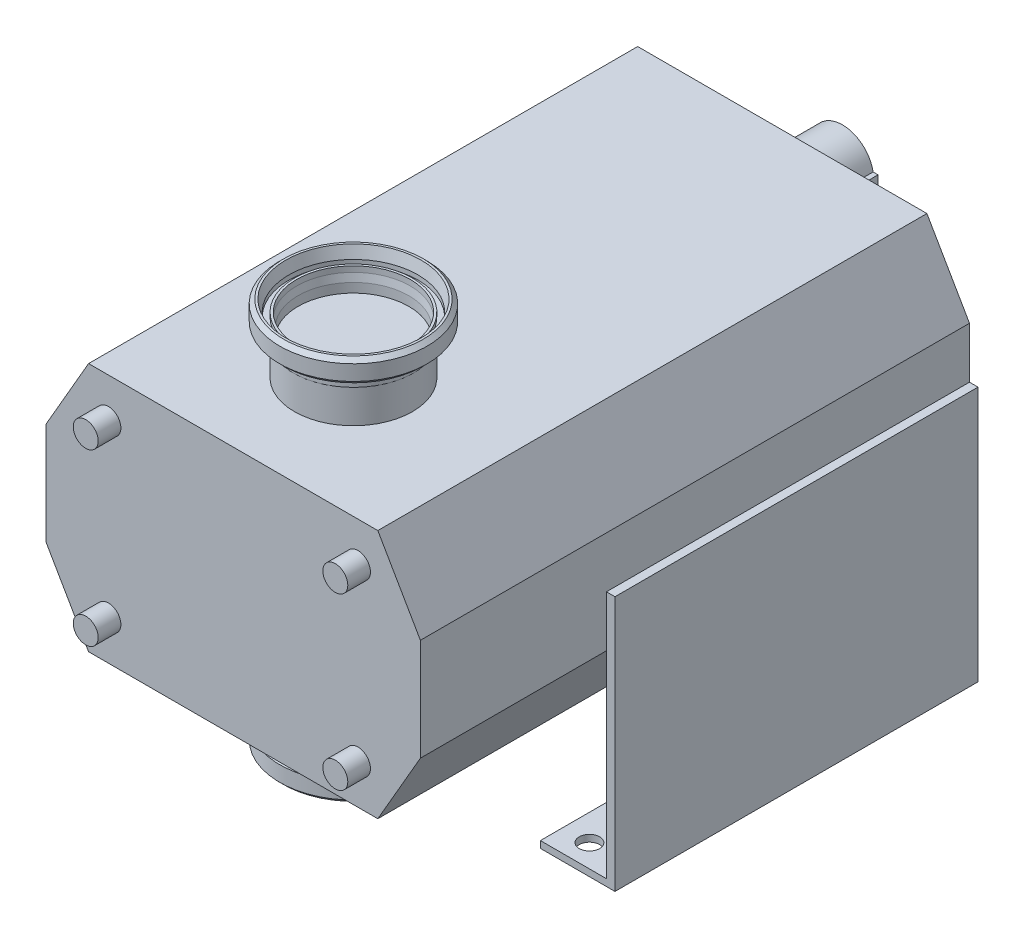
ISO-10303-21;
HEADER;
FILE_DESCRIPTION(('STEP AP214'),'2;1');
FILE_NAME('part.step','',(''),(''),'','','');
FILE_SCHEMA(('AUTOMOTIVE_DESIGN { 1 0 10303 214 1 1 1 1 }'));
ENDSEC;
DATA;
#1=APPLICATION_CONTEXT('core data for automotive mechanical design processes');
#2=APPLICATION_PROTOCOL_DEFINITION('international standard','automotive_design',2000,#1);
#3=PRODUCT_CONTEXT('',#1,'mechanical');
#4=PRODUCT('Part','Part','',(#3));
#5=PRODUCT_RELATED_PRODUCT_CATEGORY('part','',(#4));
#6=PRODUCT_DEFINITION_FORMATION('','',#4);
#7=PRODUCT_DEFINITION_CONTEXT('part definition',#1,'design');
#8=PRODUCT_DEFINITION('design','',#6,#7);
#9=PRODUCT_DEFINITION_SHAPE('','',#8);
#10=(LENGTH_UNIT() NAMED_UNIT(*) SI_UNIT(.MILLI.,.METRE.));
#11=(NAMED_UNIT(*) PLANE_ANGLE_UNIT() SI_UNIT($,.RADIAN.));
#12=(NAMED_UNIT(*) SI_UNIT($,.STERADIAN.) SOLID_ANGLE_UNIT());
#13=UNCERTAINTY_MEASURE_WITH_UNIT(LENGTH_MEASURE(1.E-05),#10,'distance_accuracy_value','');
#14=(GEOMETRIC_REPRESENTATION_CONTEXT(3) GLOBAL_UNCERTAINTY_ASSIGNED_CONTEXT((#13)) GLOBAL_UNIT_ASSIGNED_CONTEXT((#10,
#11,#12)) REPRESENTATION_CONTEXT('',''));
#15=CARTESIAN_POINT('',(0.,0.,0.));
#16=DIRECTION('',(0.,0.,1.));
#17=DIRECTION('',(1.,0.,0.));
#18=AXIS2_PLACEMENT_3D('',#15,#16,#17);
#19=CARTESIAN_POINT('',(52.,156.,378.));
#20=DIRECTION('',(0.,1.,0.));
#21=DIRECTION('',(0.,0.,1.));
#22=AXIS2_PLACEMENT_3D('',#19,#20,#21);
#23=PLANE('',#22);
#24=CARTESIAN_POINT('',(0.,156.,378.));
#25=DIRECTION('',(0.,-1.,0.));
#26=DIRECTION('',(0.,0.,-1.));
#27=AXIS2_PLACEMENT_3D('',#24,#25,#26);
#28=CIRCLE('',#27,52.);
#29=CARTESIAN_POINT('',(0.,156.,326.));
#30=VERTEX_POINT('',#29);
#31=EDGE_CURVE('P0_E67',#30,#30,#28,.T.);
#32=ORIENTED_EDGE('',*,*,#31,.T.);
#33=EDGE_LOOP('',(#32));
#34=FACE_BOUND('',#33,.T.);
#35=CARTESIAN_POINT('',(0.,156.,378.));
#36=DIRECTION('',(0.,-1.,0.));
#37=DIRECTION('',(0.,0.,-1.));
#38=AXIS2_PLACEMENT_3D('',#35,#36,#37);
#39=CIRCLE('',#38,56.9);
#40=CARTESIAN_POINT('',(0.,156.,321.1));
#41=VERTEX_POINT('',#40);
#42=EDGE_CURVE('P0_E10',#41,#41,#39,.T.);
#43=ORIENTED_EDGE('',*,*,#42,.F.);
#44=EDGE_LOOP('',(#43));
#45=FACE_BOUND('',#44,.T.);
#46=ADVANCED_FACE('P0_F15',(#34,#45),#23,.T.);
#47=CARTESIAN_POINT('',(0.,140.,378.));
#48=DIRECTION('',(0.,-1.,0.));
#49=DIRECTION('',(0.,0.,-1.));
#50=AXIS2_PLACEMENT_3D('',#47,#48,#49);
#51=CYLINDRICAL_SURFACE('',#50,56.9);
#52=ORIENTED_EDGE('',*,*,#42,.T.);
#53=EDGE_LOOP('',(#52));
#54=FACE_BOUND('',#53,.T.);
#55=CARTESIAN_POINT('',(0.,160.,378.));
#56=DIRECTION('',(0.,-1.,0.));
#57=DIRECTION('',(0.,0.,-1.));
#58=AXIS2_PLACEMENT_3D('',#55,#56,#57);
#59=CIRCLE('',#58,56.9);
#60=CARTESIAN_POINT('',(0.,160.,321.1));
#61=VERTEX_POINT('',#60);
#62=EDGE_CURVE('P0_E21',#61,#61,#59,.T.);
#63=ORIENTED_EDGE('',*,*,#62,.F.);
#64=EDGE_LOOP('',(#63));
#65=FACE_BOUND('',#64,.T.);
#66=ADVANCED_FACE('P0_F86',(#54,#65),#51,.F.);
#67=CARTESIAN_POINT('',(0.,170.,378.));
#68=DIRECTION('',(0.,1.,0.));
#69=DIRECTION('',(0.,0.,1.));
#70=AXIS2_PLACEMENT_3D('',#67,#68,#69);
#71=CONICAL_SURFACE('',#70,59.5794919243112,0.261799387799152);
#72=ORIENTED_EDGE('',*,*,#62,.T.);
#73=EDGE_LOOP('',(#72));
#74=FACE_BOUND('',#73,.T.);
#75=CARTESIAN_POINT('',(0.,170.,378.));
#76=DIRECTION('',(0.,-1.,0.));
#77=DIRECTION('',(0.,0.,-1.));
#78=AXIS2_PLACEMENT_3D('',#75,#76,#77);
#79=CIRCLE('',#78,59.5794919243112);
#80=CARTESIAN_POINT('',(0.,170.,318.420508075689));
#81=VERTEX_POINT('',#80);
#82=EDGE_CURVE('P0_E25',#81,#81,#79,.T.);
#83=ORIENTED_EDGE('',*,*,#82,.F.);
#84=EDGE_LOOP('',(#83));
#85=FACE_BOUND('',#84,.T.);
#86=ADVANCED_FACE('P0_F90',(#74,#85),#71,.F.);
#87=CARTESIAN_POINT('',(59.5794919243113,170.,378.));
#88=DIRECTION('',(0.,1.,0.));
#89=DIRECTION('',(0.,0.,1.));
#90=AXIS2_PLACEMENT_3D('',#87,#88,#89);
#91=PLANE('',#90);
#92=ORIENTED_EDGE('',*,*,#82,.T.);
#93=EDGE_LOOP('',(#92));
#94=FACE_BOUND('',#93,.T.);
#95=CARTESIAN_POINT('',(0.,170.,378.));
#96=DIRECTION('',(0.,-1.,0.));
#97=DIRECTION('',(0.,0.,-1.));
#98=AXIS2_PLACEMENT_3D('',#95,#96,#97);
#99=CIRCLE('',#98,61.5);
#100=CARTESIAN_POINT('',(0.,170.,316.5));
#101=VERTEX_POINT('',#100);
#102=EDGE_CURVE('P0_E29',#101,#101,#99,.T.);
#103=ORIENTED_EDGE('',*,*,#102,.F.);
#104=EDGE_LOOP('',(#103));
#105=FACE_BOUND('',#104,.T.);
#106=ADVANCED_FACE('P0_F94',(#94,#105),#91,.T.);
#107=CARTESIAN_POINT('',(0.,166.5,378.));
#108=DIRECTION('',(0.,-1.,0.));
#109=DIRECTION('',(0.,0.,-1.));
#110=AXIS2_PLACEMENT_3D('',#107,#108,#109);
#111=CONICAL_SURFACE('',#110,65.,0.785398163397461);
#112=ORIENTED_EDGE('',*,*,#102,.T.);
#113=EDGE_LOOP('',(#112));
#114=FACE_BOUND('',#113,.T.);
#115=CARTESIAN_POINT('',(0.,166.5,378.));
#116=DIRECTION('',(0.,-1.,0.));
#117=DIRECTION('',(0.,0.,-1.));
#118=AXIS2_PLACEMENT_3D('',#115,#116,#117);
#119=CIRCLE('',#118,65.);
#120=CARTESIAN_POINT('',(0.,166.5,313.));
#121=VERTEX_POINT('',#120);
#122=EDGE_CURVE('P0_E34',#121,#121,#119,.T.);
#123=ORIENTED_EDGE('',*,*,#122,.F.);
#124=EDGE_LOOP('',(#123));
#125=FACE_BOUND('',#124,.T.);
#126=ADVANCED_FACE('P0_F100',(#114,#125),#111,.T.);
#127=CARTESIAN_POINT('',(0.,140.,378.));
#128=DIRECTION('',(0.,-1.,0.));
#129=DIRECTION('',(0.,0.,-1.));
#130=AXIS2_PLACEMENT_3D('',#127,#128,#129);
#131=CYLINDRICAL_SURFACE('',#130,65.);
#132=ORIENTED_EDGE('',*,*,#122,.T.);
#133=EDGE_LOOP('',(#132));
#134=FACE_BOUND('',#133,.T.);
#135=CARTESIAN_POINT('',(0.,152.998779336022,378.));
#136=DIRECTION('',(0.,-1.,0.));
#137=DIRECTION('',(0.,0.,-1.));
#138=AXIS2_PLACEMENT_3D('',#135,#136,#137);
#139=CIRCLE('',#138,65.);
#140=CARTESIAN_POINT('',(0.,152.998779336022,313.));
#141=VERTEX_POINT('',#140);
#142=EDGE_CURVE('P0_E37',#141,#141,#139,.T.);
#143=ORIENTED_EDGE('',*,*,#142,.F.);
#144=EDGE_LOOP('',(#143));
#145=FACE_BOUND('',#144,.T.);
#146=ADVANCED_FACE('P0_F104',(#134,#145),#131,.T.);
#147=CARTESIAN_POINT('',(0.,149.498779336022,378.));
#148=DIRECTION('',(0.,1.,0.));
#149=DIRECTION('',(0.,0.,1.));
#150=AXIS2_PLACEMENT_3D('',#147,#148,#149);
#151=CONICAL_SURFACE('',#150,61.5,0.785398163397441);
#152=ORIENTED_EDGE('',*,*,#142,.T.);
#153=EDGE_LOOP('',(#152));
#154=FACE_BOUND('',#153,.T.);
#155=CARTESIAN_POINT('',(0.,149.498779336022,378.));
#156=DIRECTION('',(0.,-1.,0.));
#157=DIRECTION('',(0.,0.,-1.));
#158=AXIS2_PLACEMENT_3D('',#155,#156,#157);
#159=CIRCLE('',#158,61.5);
#160=CARTESIAN_POINT('',(0.,149.498779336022,316.5));
#161=VERTEX_POINT('',#160);
#162=EDGE_CURVE('P0_E40',#161,#161,#159,.T.);
#163=ORIENTED_EDGE('',*,*,#162,.F.);
#164=EDGE_LOOP('',(#163));
#165=FACE_BOUND('',#164,.T.);
#166=ADVANCED_FACE('P0_F108',(#154,#165),#151,.T.);
#167=CARTESIAN_POINT('',(0.,148.58283248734,378.));
#168=DIRECTION('',(0.,1.,0.));
#169=DIRECTION('',(0.,0.,1.));
#170=AXIS2_PLACEMENT_3D('',#167,#168,#169);
#171=CONICAL_SURFACE('',#170,56.3054072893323,1.39626340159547);
#172=ORIENTED_EDGE('',*,*,#162,.T.);
#173=EDGE_LOOP('',(#172));
#174=FACE_BOUND('',#173,.T.);
#175=CARTESIAN_POINT('',(0.,148.58283248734,378.));
#176=DIRECTION('',(0.,-1.,0.));
#177=DIRECTION('',(0.,0.,-1.));
#178=AXIS2_PLACEMENT_3D('',#175,#176,#177);
#179=CIRCLE('',#178,56.3054072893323);
#180=CARTESIAN_POINT('',(0.,148.58283248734,321.694592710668));
#181=VERTEX_POINT('',#180);
#182=EDGE_CURVE('P0_E43',#181,#181,#179,.T.);
#183=ORIENTED_EDGE('',*,*,#182,.F.);
#184=EDGE_LOOP('',(#183));
#185=FACE_BOUND('',#184,.T.);
#186=ADVANCED_FACE('P0_F112',(#174,#185),#171,.T.);
#187=CARTESIAN_POINT('',(0.,144.643601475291,378.));
#188=DIRECTION('',(0.,-1.,0.));
#189=DIRECTION('',(0.,0.,-1.));
#190=AXIS2_PLACEMENT_3D('',#187,#188,#189);
#191=TOROIDAL_SURFACE('',#190,57.,4.);
#192=ORIENTED_EDGE('',*,*,#182,.T.);
#193=EDGE_LOOP('',(#192));
#194=FACE_BOUND('',#193,.T.);
#195=CARTESIAN_POINT('',(0.,144.643601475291,378.));
#196=DIRECTION('',(0.,-1.,0.));
#197=DIRECTION('',(0.,0.,-1.));
#198=AXIS2_PLACEMENT_3D('',#195,#196,#197);
#199=CIRCLE('',#198,53.);
#200=CARTESIAN_POINT('',(0.,144.643601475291,325.));
#201=VERTEX_POINT('',#200);
#202=EDGE_CURVE('P0_E46',#201,#201,#199,.T.);
#203=ORIENTED_EDGE('',*,*,#202,.F.);
#204=EDGE_LOOP('',(#203));
#205=FACE_BOUND('',#204,.T.);
#206=ADVANCED_FACE('P0_F116',(#194,#205),#191,.F.);
#207=CARTESIAN_POINT('',(0.,140.,378.));
#208=DIRECTION('',(0.,-1.,0.));
#209=DIRECTION('',(0.,0.,-1.));
#210=AXIS2_PLACEMENT_3D('',#207,#208,#209);
#211=CYLINDRICAL_SURFACE('',#210,53.);
#212=ORIENTED_EDGE('',*,*,#202,.T.);
#213=EDGE_LOOP('',(#212));
#214=FACE_BOUND('',#213,.T.);
#215=CARTESIAN_POINT('',(0.,140.,378.));
#216=DIRECTION('',(0.,-1.,0.));
#217=DIRECTION('',(0.,0.,-1.));
#218=AXIS2_PLACEMENT_3D('',#215,#216,#217);
#219=CIRCLE('',#218,53.);
#220=CARTESIAN_POINT('',(0.,140.,325.));
#221=VERTEX_POINT('',#220);
#222=EDGE_CURVE('P0_E49',#221,#221,#219,.T.);
#223=ORIENTED_EDGE('',*,*,#222,.F.);
#224=EDGE_LOOP('',(#223));
#225=FACE_BOUND('',#224,.T.);
#226=ADVANCED_FACE('P0_F120',(#214,#225),#211,.T.);
#227=CARTESIAN_POINT('',(48.8,140.,378.));
#228=DIRECTION('',(0.,-1.,0.));
#229=DIRECTION('',(0.,0.,-1.));
#230=AXIS2_PLACEMENT_3D('',#227,#228,#229);
#231=PLANE('',#230);
#232=ORIENTED_EDGE('',*,*,#222,.T.);
#233=EDGE_LOOP('',(#232));
#234=FACE_BOUND('',#233,.T.);
#235=CARTESIAN_POINT('',(0.,140.,378.));
#236=DIRECTION('',(0.,-1.,0.));
#237=DIRECTION('',(0.,0.,-1.));
#238=AXIS2_PLACEMENT_3D('',#235,#236,#237);
#239=CIRCLE('',#238,48.8);
#240=CARTESIAN_POINT('',(0.,140.,329.2));
#241=VERTEX_POINT('',#240);
#242=EDGE_CURVE('P0_E52',#241,#241,#239,.T.);
#243=ORIENTED_EDGE('',*,*,#242,.F.);
#244=EDGE_LOOP('',(#243));
#245=FACE_BOUND('',#244,.T.);
#246=ADVANCED_FACE('P0_F124',(#234,#245),#231,.T.);
#247=CARTESIAN_POINT('',(0.,140.,378.));
#248=DIRECTION('',(0.,-1.,0.));
#249=DIRECTION('',(0.,0.,-1.));
#250=AXIS2_PLACEMENT_3D('',#247,#248,#249);
#251=CYLINDRICAL_SURFACE('',#250,48.8);
#252=ORIENTED_EDGE('',*,*,#242,.T.);
#253=EDGE_LOOP('',(#252));
#254=FACE_BOUND('',#253,.T.);
#255=CARTESIAN_POINT('',(0.,148.194461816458,378.));
#256=DIRECTION('',(0.,-1.,0.));
#257=DIRECTION('',(0.,0.,-1.));
#258=AXIS2_PLACEMENT_3D('',#255,#256,#257);
#259=CIRCLE('',#258,48.8);
#260=CARTESIAN_POINT('',(0.,148.194461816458,329.2));
#261=VERTEX_POINT('',#260);
#262=EDGE_CURVE('P0_E55',#261,#261,#259,.T.);
#263=ORIENTED_EDGE('',*,*,#262,.F.);
#264=EDGE_LOOP('',(#263));
#265=FACE_BOUND('',#264,.T.);
#266=ADVANCED_FACE('P0_F128',(#254,#265),#251,.F.);
#267=CARTESIAN_POINT('',(0.,155.,378.));
#268=DIRECTION('',(0.,1.,0.));
#269=DIRECTION('',(0.,0.,1.));
#270=AXIS2_PLACEMENT_3D('',#267,#268,#269);
#271=CONICAL_SURFACE('',#270,50.,0.174532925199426);
#272=ORIENTED_EDGE('',*,*,#262,.T.);
#273=EDGE_LOOP('',(#272));
#274=FACE_BOUND('',#273,.T.);
#275=CARTESIAN_POINT('',(0.,155.,378.));
#276=DIRECTION('',(0.,-1.,0.));
#277=DIRECTION('',(0.,0.,-1.));
#278=AXIS2_PLACEMENT_3D('',#275,#276,#277);
#279=CIRCLE('',#278,50.);
#280=CARTESIAN_POINT('',(0.,155.,328.));
#281=VERTEX_POINT('',#280);
#282=EDGE_CURVE('P0_E58',#281,#281,#279,.T.);
#283=ORIENTED_EDGE('',*,*,#282,.F.);
#284=EDGE_LOOP('',(#283));
#285=FACE_BOUND('',#284,.T.);
#286=ADVANCED_FACE('P0_F132',(#274,#285),#271,.F.);
#287=CARTESIAN_POINT('',(0.,140.,378.));
#288=DIRECTION('',(0.,-1.,0.));
#289=DIRECTION('',(0.,0.,-1.));
#290=AXIS2_PLACEMENT_3D('',#287,#288,#289);
#291=CYLINDRICAL_SURFACE('',#290,50.);
#292=ORIENTED_EDGE('',*,*,#282,.T.);
#293=EDGE_LOOP('',(#292));
#294=FACE_BOUND('',#293,.T.);
#295=CARTESIAN_POINT('',(0.,160.,378.));
#296=DIRECTION('',(0.,-1.,0.));
#297=DIRECTION('',(0.,0.,-1.));
#298=AXIS2_PLACEMENT_3D('',#295,#296,#297);
#299=CIRCLE('',#298,50.);
#300=CARTESIAN_POINT('',(0.,160.,328.));
#301=VERTEX_POINT('',#300);
#302=EDGE_CURVE('P0_E61',#301,#301,#299,.T.);
#303=ORIENTED_EDGE('',*,*,#302,.F.);
#304=EDGE_LOOP('',(#303));
#305=FACE_BOUND('',#304,.T.);
#306=ADVANCED_FACE('P0_F82',(#294,#305),#291,.F.);
#307=CARTESIAN_POINT('',(50.,160.,378.));
#308=DIRECTION('',(0.,1.,0.));
#309=DIRECTION('',(0.,0.,1.));
#310=AXIS2_PLACEMENT_3D('',#307,#308,#309);
#311=PLANE('',#310);
#312=ORIENTED_EDGE('',*,*,#302,.T.);
#313=EDGE_LOOP('',(#312));
#314=FACE_BOUND('',#313,.T.);
#315=CARTESIAN_POINT('',(0.,160.,378.));
#316=DIRECTION('',(0.,-1.,0.));
#317=DIRECTION('',(0.,0.,-1.));
#318=AXIS2_PLACEMENT_3D('',#315,#316,#317);
#319=CIRCLE('',#318,52.);
#320=CARTESIAN_POINT('',(0.,160.,326.));
#321=VERTEX_POINT('',#320);
#322=EDGE_CURVE('P0_E64',#321,#321,#319,.T.);
#323=ORIENTED_EDGE('',*,*,#322,.F.);
#324=EDGE_LOOP('',(#323));
#325=FACE_BOUND('',#324,.T.);
#326=ADVANCED_FACE('P0_F75',(#314,#325),#311,.T.);
#327=CARTESIAN_POINT('',(0.,140.,378.));
#328=DIRECTION('',(0.,-1.,0.));
#329=DIRECTION('',(0.,0.,-1.));
#330=AXIS2_PLACEMENT_3D('',#327,#328,#329);
#331=CYLINDRICAL_SURFACE('',#330,52.);
#332=ORIENTED_EDGE('',*,*,#322,.T.);
#333=EDGE_LOOP('',(#332));
#334=FACE_BOUND('',#333,.T.);
#335=ORIENTED_EDGE('',*,*,#31,.F.);
#336=EDGE_LOOP('',(#335));
#337=FACE_BOUND('',#336,.T.);
#338=ADVANCED_FACE('P0_F73',(#334,#337),#331,.T.);
#339=CLOSED_SHELL('',(#46,#66,#86,#106,#126,#146,#166,#186,#206,#226,#246,#266,#286,#306,#326,#338));
#340=MANIFOLD_SOLID_BREP('P0_B1',#339);
#341=CARTESIAN_POINT('',(-106.773910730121,-225.,320.));
#342=DIRECTION('',(0.,1.,0.));
#343=DIRECTION('',(0.,0.,1.));
#344=AXIS2_PLACEMENT_3D('',#341,#342,#343);
#345=PLANE('',#344);
#346=CARTESIAN_POINT('',(-130.,-225.,300.));
#347=DIRECTION('',(0.,1.,0.));
#348=DIRECTION('',(0.,0.,-1.));
#349=AXIS2_PLACEMENT_3D('',#346,#347,#348);
#350=CIRCLE('',#349,9.00000000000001);
#351=CARTESIAN_POINT('',(-130.,-225.,291.));
#352=VERTEX_POINT('',#351);
#353=EDGE_CURVE('P1_E575',#352,#352,#350,.T.);
#354=ORIENTED_EDGE('',*,*,#353,.T.);
#355=EDGE_LOOP('',(#354));
#356=FACE_BOUND('',#355,.T.);
#357=DIRECTION('',(1.,0.,0.));
#358=VECTOR('',#357,1.);
#359=CARTESIAN_POINT('',(-106.773910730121,-225.,0.));
#360=LINE('',#359,#358);
#361=CARTESIAN_POINT('',(-172.5,-225.,0.));
#362=VERTEX_POINT('',#361);
#363=CARTESIAN_POINT('',(-106.773910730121,-225.,0.));
#364=VERTEX_POINT('',#363);
#365=EDGE_CURVE('P1_E586',#362,#364,#360,.T.);
#366=ORIENTED_EDGE('',*,*,#365,.T.);
#367=DIRECTION('',(0.,0.,-1.));
#368=VECTOR('',#367,1.);
#369=CARTESIAN_POINT('',(-106.773910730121,-225.,320.));
#370=LINE('',#369,#368);
#371=CARTESIAN_POINT('',(-106.773910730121,-225.,320.));
#372=VERTEX_POINT('',#371);
#373=EDGE_CURVE('P1_E593',#372,#364,#370,.T.);
#374=ORIENTED_EDGE('',*,*,#373,.F.);
#375=DIRECTION('',(1.,0.,0.));
#376=VECTOR('',#375,1.);
#377=CARTESIAN_POINT('',(-106.773910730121,-225.,320.));
#378=LINE('',#377,#376);
#379=CARTESIAN_POINT('',(-172.5,-225.,320.));
#380=VERTEX_POINT('',#379);
#381=EDGE_CURVE('P1_E217',#380,#372,#378,.T.);
#382=ORIENTED_EDGE('',*,*,#381,.F.);
#383=DIRECTION('',(0.,0.,-1.));
#384=VECTOR('',#383,1.);
#385=CARTESIAN_POINT('',(-172.5,-225.,320.));
#386=LINE('',#385,#384);
#387=EDGE_CURVE('P1_E590',#380,#362,#386,.T.);
#388=ORIENTED_EDGE('',*,*,#387,.T.);
#389=EDGE_LOOP('',(#366,#374,#382,#388));
#390=FACE_BOUND('',#389,.T.);
#391=CARTESIAN_POINT('',(-130.,-225.,20.));
#392=DIRECTION('',(0.,1.,0.));
#393=DIRECTION('',(0.,0.,-1.));
#394=AXIS2_PLACEMENT_3D('',#391,#392,#393);
#395=CIRCLE('',#394,9.00000000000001);
#396=CARTESIAN_POINT('',(-130.,-225.,11.));
#397=VERTEX_POINT('',#396);
#398=EDGE_CURVE('P1_E883',#397,#397,#395,.T.);
#399=ORIENTED_EDGE('',*,*,#398,.T.);
#400=EDGE_LOOP('',(#399));
#401=FACE_BOUND('',#400,.T.);
#402=ADVANCED_FACE('P1_F17',(#356,#390,#401),#345,.F.);
#403=CARTESIAN_POINT('',(-165.,-219.,320.));
#404=DIRECTION('',(0.,-1.,0.));
#405=DIRECTION('',(0.,0.,-1.));
#406=AXIS2_PLACEMENT_3D('',#403,#404,#405);
#407=PLANE('',#406);
#408=CARTESIAN_POINT('',(-130.,-219.,300.));
#409=DIRECTION('',(0.,-1.,0.));
#410=DIRECTION('',(0.,0.,-1.));
#411=AXIS2_PLACEMENT_3D('',#408,#409,#410);
#412=CIRCLE('',#411,9.00000000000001);
#413=CARTESIAN_POINT('',(-130.,-219.,291.));
#414=VERTEX_POINT('',#413);
#415=EDGE_CURVE('P1_E579',#414,#414,#412,.T.);
#416=ORIENTED_EDGE('',*,*,#415,.T.);
#417=EDGE_LOOP('',(#416));
#418=FACE_BOUND('',#417,.T.);
#419=DIRECTION('',(-1.,0.,0.));
#420=VECTOR('',#419,1.);
#421=CARTESIAN_POINT('',(-165.,-219.,0.));
#422=LINE('',#421,#420);
#423=CARTESIAN_POINT('',(-106.773910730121,-219.,0.));
#424=VERTEX_POINT('',#423);
#425=CARTESIAN_POINT('',(-165.,-219.,0.));
#426=VERTEX_POINT('',#425);
#427=EDGE_CURVE('P1_E577',#424,#426,#422,.T.);
#428=ORIENTED_EDGE('',*,*,#427,.T.);
#429=DIRECTION('',(0.,0.,-1.));
#430=VECTOR('',#429,1.);
#431=CARTESIAN_POINT('',(-165.,-219.,320.));
#432=LINE('',#431,#430);
#433=CARTESIAN_POINT('',(-165.,-219.,320.));
#434=VERTEX_POINT('',#433);
#435=EDGE_CURVE('P1_E211',#434,#426,#432,.T.);
#436=ORIENTED_EDGE('',*,*,#435,.F.);
#437=DIRECTION('',(-1.,0.,0.));
#438=VECTOR('',#437,1.);
#439=CARTESIAN_POINT('',(-165.,-219.,320.));
#440=LINE('',#439,#438);
#441=CARTESIAN_POINT('',(-106.773910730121,-219.,320.));
#442=VERTEX_POINT('',#441);
#443=EDGE_CURVE('P1_E602',#442,#434,#440,.T.);
#444=ORIENTED_EDGE('',*,*,#443,.F.);
#445=DIRECTION('',(0.,0.,-1.));
#446=VECTOR('',#445,1.);
#447=CARTESIAN_POINT('',(-106.773910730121,-219.,320.));
#448=LINE('',#447,#446);
#449=EDGE_CURVE('P1_E215',#442,#424,#448,.T.);
#450=ORIENTED_EDGE('',*,*,#449,.T.);
#451=EDGE_LOOP('',(#428,#436,#444,#450));
#452=FACE_BOUND('',#451,.T.);
#453=CARTESIAN_POINT('',(-130.,-219.,20.));
#454=DIRECTION('',(0.,-1.,0.));
#455=DIRECTION('',(0.,0.,-1.));
#456=AXIS2_PLACEMENT_3D('',#453,#454,#455);
#457=CIRCLE('',#456,9.00000000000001);
#458=CARTESIAN_POINT('',(-130.,-219.,11.));
#459=VERTEX_POINT('',#458);
#460=EDGE_CURVE('P1_E886',#459,#459,#457,.T.);
#461=ORIENTED_EDGE('',*,*,#460,.T.);
#462=EDGE_LOOP('',(#461));
#463=FACE_BOUND('',#462,.T.);
#464=ADVANCED_FACE('P1_F455',(#418,#452,#463),#407,.F.);
#465=CARTESIAN_POINT('',(-165.,45.,484.));
#466=DIRECTION('',(1.,0.,0.));
#467=DIRECTION('',(0.,0.,-1.));
#468=AXIS2_PLACEMENT_3D('',#465,#466,#467);
#469=PLANE('',#468);
#470=DIRECTION('',(0.,0.,-1.));
#471=VECTOR('',#470,1.);
#472=CARTESIAN_POINT('',(-165.,0.,320.));
#473=LINE('',#472,#471);
#474=CARTESIAN_POINT('',(-165.,0.,320.));
#475=VERTEX_POINT('',#474);
#476=CARTESIAN_POINT('',(-165.,0.,0.));
#477=VERTEX_POINT('',#476);
#478=EDGE_CURVE('P1_E200',#475,#477,#473,.T.);
#479=ORIENTED_EDGE('',*,*,#478,.F.);
#480=DIRECTION('',(0.,1.,0.));
#481=VECTOR('',#480,1.);
#482=CARTESIAN_POINT('',(-165.,0.,320.));
#483=LINE('',#482,#481);
#484=CARTESIAN_POINT('',(-165.,-44.9999999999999,320.));
#485=VERTEX_POINT('',#484);
#486=EDGE_CURVE('P1_E185',#485,#475,#483,.T.);
#487=ORIENTED_EDGE('',*,*,#486,.F.);
#488=DIRECTION('',(0.,0.,-1.));
#489=VECTOR('',#488,1.);
#490=CARTESIAN_POINT('',(-165.,-45.,484.));
#491=LINE('',#490,#489);
#492=CARTESIAN_POINT('',(-165.,-45.,484.));
#493=VERTEX_POINT('',#492);
#494=EDGE_CURVE('P1_E395',#493,#485,#491,.T.);
#495=ORIENTED_EDGE('',*,*,#494,.F.);
#496=DIRECTION('',(0.,-1.,0.));
#497=VECTOR('',#496,1.);
#498=CARTESIAN_POINT('',(-165.,45.,484.));
#499=LINE('',#498,#497);
#500=CARTESIAN_POINT('',(-165.,45.,484.));
#501=VERTEX_POINT('',#500);
#502=EDGE_CURVE('P1_E359',#501,#493,#499,.T.);
#503=ORIENTED_EDGE('',*,*,#502,.F.);
#504=DIRECTION('',(0.,0.,-1.));
#505=VECTOR('',#504,1.);
#506=CARTESIAN_POINT('',(-165.,45.,484.));
#507=LINE('',#506,#505);
#508=CARTESIAN_POINT('',(-165.,45.,0.));
#509=VERTEX_POINT('',#508);
#510=EDGE_CURVE('P1_E397',#501,#509,#507,.T.);
#511=ORIENTED_EDGE('',*,*,#510,.T.);
#512=DIRECTION('',(0.,-1.,0.));
#513=VECTOR('',#512,1.);
#514=CARTESIAN_POINT('',(-165.,45.,0.));
#515=LINE('',#514,#513);
#516=EDGE_CURVE('P1_E210',#509,#477,#515,.T.);
#517=ORIENTED_EDGE('',*,*,#516,.T.);
#518=EDGE_LOOP('',(#479,#487,#495,#503,#511,#517));
#519=FACE_BOUND('',#518,.T.);
#520=ADVANCED_FACE('P1_F207',(#519),#469,.F.);
#521=CARTESIAN_POINT('',(-60.,0.,241.732657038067));
#522=DIRECTION('',(0.,0.,1.));
#523=DIRECTION('',(1.,0.,0.));
#524=AXIS2_PLACEMENT_3D('',#521,#522,#523);
#525=CYLINDRICAL_SURFACE('',#524,27.5);
#526=CARTESIAN_POINT('',(-60.,0.,-3.));
#527=DIRECTION('',(0.,0.,1.));
#528=DIRECTION('',(1.,0.,0.));
#529=AXIS2_PLACEMENT_3D('',#526,#527,#528);
#530=CIRCLE('',#529,27.5);
#531=CARTESIAN_POINT('',(-32.5,0.,-3.));
#532=VERTEX_POINT('',#531);
#533=EDGE_CURVE('P1_E320',#532,#532,#530,.T.);
#534=ORIENTED_EDGE('',*,*,#533,.F.);
#535=EDGE_LOOP('',(#534));
#536=FACE_BOUND('',#535,.T.);
#537=DIRECTION('',(0.,0.,1.));
#538=VECTOR('',#537,1.);
#539=CARTESIAN_POINT('',(-32.9583654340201,4.99999999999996,241.732657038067));
#540=LINE('',#539,#538);
#541=CARTESIAN_POINT('',(-32.9583654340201,5.00000000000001,-113.));
#542=VERTEX_POINT('',#541);
#543=CARTESIAN_POINT('',(-32.9583654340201,5.,-63.));
#544=VERTEX_POINT('',#543);
#545=EDGE_CURVE('P1_E305',#542,#544,#540,.T.);
#546=ORIENTED_EDGE('',*,*,#545,.F.);
#547=CARTESIAN_POINT('',(-60.,0.,-113.));
#548=DIRECTION('',(0.,0.,1.));
#549=DIRECTION('',(1.,0.,0.));
#550=AXIS2_PLACEMENT_3D('',#547,#548,#549);
#551=CIRCLE('',#550,27.5);
#552=CARTESIAN_POINT('',(-32.9583654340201,-4.99999999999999,-113.));
#553=VERTEX_POINT('',#552);
#554=EDGE_CURVE('P1_E318',#542,#553,#551,.T.);
#555=ORIENTED_EDGE('',*,*,#554,.T.);
#556=DIRECTION('',(0.,0.,1.));
#557=VECTOR('',#556,1.);
#558=CARTESIAN_POINT('',(-32.9583654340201,-5.00000000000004,241.732657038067));
#559=LINE('',#558,#557);
#560=CARTESIAN_POINT('',(-32.9583654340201,-5.00000000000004,-62.9999999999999));
#561=VERTEX_POINT('',#560);
#562=EDGE_CURVE('P1_E302',#561,#553,#559,.F.);
#563=ORIENTED_EDGE('',*,*,#562,.F.);
#564=CARTESIAN_POINT('',(-32.5,0.,-68.));
#565=CARTESIAN_POINT('',(-32.4999988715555,0.139243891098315,-68.0000024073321));
#566=CARTESIAN_POINT('',(-32.5010594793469,0.278456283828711,-67.9941816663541));
#567=CARTESIAN_POINT('',(-32.5052698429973,0.555920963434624,-67.9709482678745));
#568=CARTESIAN_POINT('',(-32.5084199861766,0.69417306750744,-67.9535334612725));
#569=CARTESIAN_POINT('',(-32.5167252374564,0.968758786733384,-67.9072300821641));
#570=CARTESIAN_POINT('',(-32.5218815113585,1.10509123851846,-67.8783348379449));
#571=CARTESIAN_POINT('',(-32.5340566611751,1.37484220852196,-67.809282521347));
#572=CARTESIAN_POINT('',(-32.5410762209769,1.50825963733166,-67.7691213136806));
#573=CARTESIAN_POINT('',(-32.5567718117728,1.77102525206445,-67.6779041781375));
#574=CARTESIAN_POINT('',(-32.5654457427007,1.90037835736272,-67.6268620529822));
#575=CARTESIAN_POINT('',(-32.5842196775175,2.15434684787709,-67.5142102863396));
#576=CARTESIAN_POINT('',(-32.5943202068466,2.27896046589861,-67.4525967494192));
#577=CARTESIAN_POINT('',(-32.6156621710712,2.52249441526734,-67.3192919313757));
#578=CARTESIAN_POINT('',(-32.6269030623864,2.64141741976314,-67.2476054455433));
#579=CARTESIAN_POINT('',(-32.6502265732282,2.87287846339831,-67.0946089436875));
#580=CARTESIAN_POINT('',(-32.6623095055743,2.98541410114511,-67.0132953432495));
#581=CARTESIAN_POINT('',(-32.6871037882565,3.20436568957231,-66.8407881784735));
#582=CARTESIAN_POINT('',(-32.6998201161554,3.31071129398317,-66.7495060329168));
#583=CARTESIAN_POINT('',(-32.7254213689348,3.51539543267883,-66.5583162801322));
#584=CARTESIAN_POINT('',(-32.7383063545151,3.61373098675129,-66.458405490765));
#585=CARTESIAN_POINT('',(-32.7638763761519,3.80165254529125,-66.2506992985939));
#586=CARTESIAN_POINT('',(-32.7765614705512,3.89124114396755,-66.1429062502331));
#587=CARTESIAN_POINT('',(-32.8013837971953,4.06111440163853,-65.9200997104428));
#588=CARTESIAN_POINT('',(-32.8135208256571,4.14139561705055,-65.8050835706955));
#589=CARTESIAN_POINT('',(-32.8369804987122,4.29258292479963,-65.5678120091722));
#590=CARTESIAN_POINT('',(-32.8482967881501,4.36341882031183,-65.4455112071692));
#591=CARTESIAN_POINT('',(-32.869695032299,4.4945486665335,-65.1952227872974));
#592=CARTESIAN_POINT('',(-32.8797765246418,4.55483867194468,-65.0672330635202));
#593=CARTESIAN_POINT('',(-32.8983991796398,4.66436791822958,-64.8065544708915));
#594=CARTESIAN_POINT('',(-32.9069410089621,4.71361194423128,-64.6738676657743));
#595=CARTESIAN_POINT('',(-32.922240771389,4.8007169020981,-64.4046947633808));
#596=CARTESIAN_POINT('',(-32.9289980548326,4.83857368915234,-64.2682073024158));
#597=CARTESIAN_POINT('',(-32.9461329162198,4.93382551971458,-63.8576226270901));
#598=CARTESIAN_POINT('',(-32.9536068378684,4.97422708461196,-63.579236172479));
#599=CARTESIAN_POINT('',(-32.9598077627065,5.00782079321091,-63.0196963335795));
#600=CARTESIAN_POINT('',(-32.9585355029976,5.00101691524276,-62.7385431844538));
#601=CARTESIAN_POINT('',(-32.9474824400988,4.94086952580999,-62.1849314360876));
#602=CARTESIAN_POINT('',(-32.9378069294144,4.88810191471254,-61.9124083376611));
#603=CARTESIAN_POINT('',(-32.9111987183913,4.73841411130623,-61.3801594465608));
#604=CARTESIAN_POINT('',(-32.8942657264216,4.64149214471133,-61.120434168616));
#605=CARTESIAN_POINT('',(-32.854940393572,4.40568216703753,-60.619443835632));
#606=CARTESIAN_POINT('',(-32.8325176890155,4.2665596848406,-60.3782916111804));
#607=CARTESIAN_POINT('',(-32.7847594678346,3.95046265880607,-59.9225379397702));
#608=CARTESIAN_POINT('',(-32.7594236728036,3.7734844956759,-59.7079390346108));
#609=CARTESIAN_POINT('',(-32.7082339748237,3.38358496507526,-59.3080525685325));
#610=CARTESIAN_POINT('',(-32.6823779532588,3.17017042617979,-59.1232457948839));
#611=CARTESIAN_POINT('',(-32.6334062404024,2.71511135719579,-58.7919871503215));
#612=CARTESIAN_POINT('',(-32.6102905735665,2.4734665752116,-58.6455356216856));
#613=CARTESIAN_POINT('',(-32.5693615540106,1.96831899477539,-58.3950815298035));
#614=CARTESIAN_POINT('',(-32.5515541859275,1.70479195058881,-58.2911268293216));
#615=CARTESIAN_POINT('',(-32.5232948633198,1.16362103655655,-58.1290920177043));
#616=CARTESIAN_POINT('',(-32.5128421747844,0.885978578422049,-58.0710073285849));
#617=CARTESIAN_POINT('',(-32.5005701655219,0.3285966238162,-58.0030255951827));
#618=CARTESIAN_POINT('',(-32.4986327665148,0.048940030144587,-57.9924694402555));
#619=CARTESIAN_POINT('',(-32.5032842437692,-0.508143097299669,-58.018079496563));
#620=CARTESIAN_POINT('',(-32.5098727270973,-0.78556973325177,-58.0542435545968));
#621=CARTESIAN_POINT('',(-32.5307622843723,-1.32824274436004,-58.1717193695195));
#622=CARTESIAN_POINT('',(-32.5450067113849,-1.59356324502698,-58.2526996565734));
#623=CARTESIAN_POINT('',(-32.5796176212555,-2.10686178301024,-58.4571520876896));
#624=CARTESIAN_POINT('',(-32.5999845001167,-2.35483869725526,-58.5806269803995));
#625=CARTESIAN_POINT('',(-32.644875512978,-2.82923812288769,-58.8680365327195));
#626=CARTESIAN_POINT('',(-32.6694404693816,-3.05541114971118,-59.0323764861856));
#627=CARTESIAN_POINT('',(-32.7198927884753,-3.47720532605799,-59.3963011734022));
#628=CARTESIAN_POINT('',(-32.7457802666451,-3.67282380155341,-59.5958889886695));
#629=CARTESIAN_POINT('',(-32.796349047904,-4.03044352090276,-60.0276163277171));
#630=CARTESIAN_POINT('',(-32.8210113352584,-4.19199619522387,-60.2601299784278));
#631=CARTESIAN_POINT('',(-32.8659621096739,-4.47374938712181,-60.7493937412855));
#632=CARTESIAN_POINT('',(-32.8862507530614,-4.59395138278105,-61.0061429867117));
#633=CARTESIAN_POINT('',(-32.9200118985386,-4.78894965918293,-61.5353646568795));
#634=CARTESIAN_POINT('',(-32.933515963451,-4.86395652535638,-61.80775757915));
#635=CARTESIAN_POINT('',(-32.9522449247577,-4.96707217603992,-62.3617029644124));
#636=CARTESIAN_POINT('',(-32.9574706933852,-4.99518590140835,-62.6432544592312));
#637=CARTESIAN_POINT('',(-32.9586508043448,-5.00153102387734,-63.0637361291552));
#638=CARTESIAN_POINT('',(-32.9579621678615,-4.99782447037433,-63.2026140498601));
#639=CARTESIAN_POINT('',(-32.9544668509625,-4.97888166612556,-63.4795403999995));
#640=CARTESIAN_POINT('',(-32.9516609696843,-4.96364976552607,-63.6175891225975));
#641=CARTESIAN_POINT('',(-32.9440080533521,-4.92176219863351,-63.8919241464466));
#642=CARTESIAN_POINT('',(-32.9391602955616,-4.89510248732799,-64.0282098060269));
#643=CARTESIAN_POINT('',(-32.9275679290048,-4.83057933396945,-64.2979701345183));
#644=CARTESIAN_POINT('',(-32.9208240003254,-4.79271990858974,-64.4314457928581));
#645=CARTESIAN_POINT('',(-32.905642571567,-4.70613665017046,-64.6945299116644));
#646=CARTESIAN_POINT('',(-32.8972073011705,-4.65742711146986,-64.8241432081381));
#647=CARTESIAN_POINT('',(-32.8788810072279,-4.54949424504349,-65.0787530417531));
#648=CARTESIAN_POINT('',(-32.868990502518,-4.49027466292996,-65.2037512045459));
#649=CARTESIAN_POINT('',(-32.8480252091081,-4.36170911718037,-65.4483862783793));
#650=CARTESIAN_POINT('',(-32.836949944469,-4.29235907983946,-65.568021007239));
#651=CARTESIAN_POINT('',(-32.8139305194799,-4.1440622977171,-65.8010379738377));
#652=CARTESIAN_POINT('',(-32.8019866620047,-4.06511889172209,-65.9144223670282));
#653=CARTESIAN_POINT('',(-32.7773783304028,-3.8969465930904,-66.1358269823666));
#654=CARTESIAN_POINT('',(-32.7647059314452,-3.80758543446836,-66.2437458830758));
#655=CARTESIAN_POINT('',(-32.7391619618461,-3.62017233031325,-66.4516566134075));
#656=CARTESIAN_POINT('',(-32.7262904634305,-3.52212347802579,-66.5516512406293));
#657=CARTESIAN_POINT('',(-32.700695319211,-3.31791447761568,-66.743133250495));
#658=CARTESIAN_POINT('',(-32.6879717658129,-3.21174954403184,-66.8346155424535));
#659=CARTESIAN_POINT('',(-32.6630392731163,-2.99212066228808,-67.0083427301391));
#660=CARTESIAN_POINT('',(-32.6508301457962,-2.87865941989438,-67.0905910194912));
#661=CARTESIAN_POINT('',(-32.6271575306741,-2.64414496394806,-67.2459930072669));
#662=CARTESIAN_POINT('',(-32.6157015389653,-2.52303379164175,-67.3190604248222));
#663=CARTESIAN_POINT('',(-32.5939830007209,-2.27502120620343,-67.4546883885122));
#664=CARTESIAN_POINT('',(-32.5837200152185,-2.14812194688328,-67.5172528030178));
#665=CARTESIAN_POINT('',(-32.5646811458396,-1.8894645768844,-67.6314025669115));
#666=CARTESIAN_POINT('',(-32.5559042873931,-1.75770971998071,-67.6829951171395));
#667=CARTESIAN_POINT('',(-32.5400817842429,-1.4902518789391,-67.7748453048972));
#668=CARTESIAN_POINT('',(-32.5330357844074,-1.35454971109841,-67.815105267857));
#669=CARTESIAN_POINT('',(-32.5181567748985,-1.01869381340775,-67.8994044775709));
#670=CARTESIAN_POINT('',(-32.5113812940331,-0.816859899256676,-67.9370801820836));
#671=CARTESIAN_POINT('',(-32.5023037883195,-0.409994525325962,-67.9873758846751));
#672=CARTESIAN_POINT('',(-32.500001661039,-0.2049631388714,-67.999996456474));
#673=CARTESIAN_POINT('',(-32.5,0.,-68.));
#674=B_SPLINE_CURVE_WITH_KNOTS('',3,(#564,#565,#566,#567,#568,#569,#570,#571,#572,#573,#574,
#575,#576,#577,#578,#579,#580,#581,#582,#583,#584,#585,#586,#587,#588,#589,#590,#591,#592,#593,
#594,#595,#596,#597,#598,#599,#600,#601,#602,#603,#604,#605,#606,#607,#608,#609,#610,#611,#612,
#613,#614,#615,#616,#617,#618,#619,#620,#621,#622,#623,#624,#625,#626,#627,#628,#629,#630,#631,
#632,#633,#634,#635,#636,#637,#638,#639,#640,#641,#642,#643,#644,#645,#646,#647,#648,#649,#650,
#651,#652,#653,#654,#655,#656,#657,#658,#659,#660,#661,#662,#663,#664,#665,#666,#667,#668,#669,
#670,#671,#672,#673),.UNSPECIFIED.,.T.,.F.,(4,2,2,2,2,2,2,2,2,2,2,2,2,2,2,2,2,2,2,2,2,2,2,2,2,2,
2,2,2,2,2,2,2,2,2,2,2,2,2,2,2,2,2,2,2,2,2,2,2,2,2,2,2,2,4),(0.,0.417551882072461,
0.835181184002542,1.25305354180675,1.67107948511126,2.0885782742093,2.50623123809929,
2.9236860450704,3.34129677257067,3.76297827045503,4.18481594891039,4.60652813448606,
5.02839585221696,5.45324223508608,5.87824721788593,6.3030677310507,6.72804268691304,
7.56780375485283,8.40749405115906,9.23681240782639,10.0661640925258,10.9002108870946,
11.7343374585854,12.5808084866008,13.4272870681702,14.2747164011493,15.1220611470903,
15.9576182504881,16.7931368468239,17.6225568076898,18.4520304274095,19.2900838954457,
20.1282106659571,20.9767658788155,21.8252907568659,22.6698307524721,23.5142817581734,
23.9306627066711,24.3468865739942,24.7632578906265,25.1794800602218,25.595157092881,
26.0106862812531,26.4263830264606,26.8419355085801,27.2634991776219,27.6849133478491,
28.1065779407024,28.5280870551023,28.9533006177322,29.3783572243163,29.8031339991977,
30.2278235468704,30.8424623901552,31.4570871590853),.UNSPECIFIED.);
#675=EDGE_CURVE('P1_E25',#544,#561,#674,.T.);
#676=ORIENTED_EDGE('',*,*,#675,.F.);
#677=EDGE_LOOP('',(#546,#555,#563,#676));
#678=FACE_BOUND('',#677,.T.);
#679=ADVANCED_FACE('P1_F414',(#536,#678),#525,.T.);
#680=CARTESIAN_POINT('',(190.980762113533,0.,0.));
#681=DIRECTION('',(0.,0.,1.));
#682=DIRECTION('',(1.,0.,0.));
#683=AXIS2_PLACEMENT_3D('',#680,#681,#682);
#684=PLANE('',#683);
#685=DIRECTION('',(-0.500000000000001,0.866025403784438,0.));
#686=VECTOR('',#685,1.);
#687=CARTESIAN_POINT('',(127.472232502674,110.,0.));
#688=LINE('',#687,#686);
#689=CARTESIAN_POINT('',(165.,45.,0.));
#690=VERTEX_POINT('',#689);
#691=CARTESIAN_POINT('',(127.472232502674,110.,0.));
#692=VERTEX_POINT('',#691);
#693=EDGE_CURVE('P1_E348',#690,#692,#688,.T.);
#694=ORIENTED_EDGE('',*,*,#693,.F.);
#695=DIRECTION('',(0.,1.,0.));
#696=VECTOR('',#695,1.);
#697=CARTESIAN_POINT('',(165.,45.,0.));
#698=LINE('',#697,#696);
#699=CARTESIAN_POINT('',(165.,0.,0.));
#700=VERTEX_POINT('',#699);
#701=EDGE_CURVE('P1_E355',#700,#690,#698,.T.);
#702=ORIENTED_EDGE('',*,*,#701,.F.);
#703=DIRECTION('',(1.,0.,0.));
#704=VECTOR('',#703,1.);
#705=CARTESIAN_POINT('',(172.5,0.,0.));
#706=LINE('',#705,#704);
#707=CARTESIAN_POINT('',(172.5,0.,0.));
#708=VERTEX_POINT('',#707);
#709=EDGE_CURVE('P1_E231',#700,#708,#706,.T.);
#710=ORIENTED_EDGE('',*,*,#709,.T.);
#711=DIRECTION('',(0.,-1.,0.));
#712=VECTOR('',#711,1.);
#713=CARTESIAN_POINT('',(172.5,-225.,0.));
#714=LINE('',#713,#712);
#715=CARTESIAN_POINT('',(172.5,-225.,0.));
#716=VERTEX_POINT('',#715);
#717=EDGE_CURVE('P1_E256',#708,#716,#714,.T.);
#718=ORIENTED_EDGE('',*,*,#717,.T.);
#719=DIRECTION('',(-1.,0.,0.));
#720=VECTOR('',#719,1.);
#721=CARTESIAN_POINT('',(106.773910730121,-225.,0.));
#722=LINE('',#721,#720);
#723=CARTESIAN_POINT('',(106.773910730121,-225.,0.));
#724=VERTEX_POINT('',#723);
#725=EDGE_CURVE('P1_E259',#716,#724,#722,.T.);
#726=ORIENTED_EDGE('',*,*,#725,.T.);
#727=DIRECTION('',(0.,1.,0.));
#728=VECTOR('',#727,1.);
#729=CARTESIAN_POINT('',(106.773910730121,-219.,0.));
#730=LINE('',#729,#728);
#731=CARTESIAN_POINT('',(106.773910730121,-219.,0.));
#732=VERTEX_POINT('',#731);
#733=EDGE_CURVE('P1_E262',#724,#732,#730,.T.);
#734=ORIENTED_EDGE('',*,*,#733,.T.);
#735=DIRECTION('',(1.,0.,0.));
#736=VECTOR('',#735,1.);
#737=CARTESIAN_POINT('',(165.,-219.,0.));
#738=LINE('',#737,#736);
#739=CARTESIAN_POINT('',(165.,-219.,0.));
#740=VERTEX_POINT('',#739);
#741=EDGE_CURVE('P1_E265',#732,#740,#738,.T.);
#742=ORIENTED_EDGE('',*,*,#741,.T.);
#743=DIRECTION('',(0.,1.,0.));
#744=VECTOR('',#743,1.);
#745=CARTESIAN_POINT('',(165.,0.,0.));
#746=LINE('',#745,#744);
#747=CARTESIAN_POINT('',(165.,-45.,0.));
#748=VERTEX_POINT('',#747);
#749=EDGE_CURVE('P1_E238',#740,#748,#746,.T.);
#750=ORIENTED_EDGE('',*,*,#749,.T.);
#751=DIRECTION('',(0.500000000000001,0.866025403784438,0.));
#752=VECTOR('',#751,1.);
#753=CARTESIAN_POINT('',(127.472232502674,-110.,0.));
#754=LINE('',#753,#752);
#755=CARTESIAN_POINT('',(127.472232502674,-110.,0.));
#756=VERTEX_POINT('',#755);
#757=EDGE_CURVE('P1_E381',#756,#748,#754,.T.);
#758=ORIENTED_EDGE('',*,*,#757,.F.);
#759=DIRECTION('',(1.,0.,0.));
#760=VECTOR('',#759,1.);
#761=CARTESIAN_POINT('',(-127.472232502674,-110.,0.));
#762=LINE('',#761,#760);
#763=CARTESIAN_POINT('',(-127.472232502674,-110.,0.));
#764=VERTEX_POINT('',#763);
#765=EDGE_CURVE('P1_E379',#764,#756,#762,.T.);
#766=ORIENTED_EDGE('',*,*,#765,.F.);
#767=DIRECTION('',(0.500000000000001,-0.866025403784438,0.));
#768=VECTOR('',#767,1.);
#769=CARTESIAN_POINT('',(-127.472232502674,-110.,0.));
#770=LINE('',#769,#768);
#771=CARTESIAN_POINT('',(-165.,-45.,0.));
#772=VERTEX_POINT('',#771);
#773=EDGE_CURVE('P1_E377',#772,#764,#770,.T.);
#774=ORIENTED_EDGE('',*,*,#773,.F.);
#775=DIRECTION('',(0.,1.,0.));
#776=VECTOR('',#775,1.);
#777=CARTESIAN_POINT('',(-165.,0.,0.));
#778=LINE('',#777,#776);
#779=EDGE_CURVE('P1_E574',#426,#772,#778,.T.);
#780=ORIENTED_EDGE('',*,*,#779,.F.);
#781=ORIENTED_EDGE('',*,*,#427,.F.);
#782=DIRECTION('',(0.,1.,0.));
#783=VECTOR('',#782,1.);
#784=CARTESIAN_POINT('',(-106.773910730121,-219.,0.));
#785=LINE('',#784,#783);
#786=EDGE_CURVE('P1_E584',#364,#424,#785,.T.);
#787=ORIENTED_EDGE('',*,*,#786,.F.);
#788=ORIENTED_EDGE('',*,*,#365,.F.);
#789=DIRECTION('',(0.,-1.,0.));
#790=VECTOR('',#789,1.);
#791=CARTESIAN_POINT('',(-172.5,-225.,0.));
#792=LINE('',#791,#790);
#793=CARTESIAN_POINT('',(-172.5,0.,0.));
#794=VERTEX_POINT('',#793);
#795=EDGE_CURVE('P1_E204',#794,#362,#792,.T.);
#796=ORIENTED_EDGE('',*,*,#795,.F.);
#797=DIRECTION('',(-1.,0.,0.));
#798=VECTOR('',#797,1.);
#799=CARTESIAN_POINT('',(-172.5,0.,0.));
#800=LINE('',#799,#798);
#801=EDGE_CURVE('P1_E572',#477,#794,#800,.T.);
#802=ORIENTED_EDGE('',*,*,#801,.F.);
#803=ORIENTED_EDGE('',*,*,#516,.F.);
#804=DIRECTION('',(-0.500000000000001,-0.866025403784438,0.));
#805=VECTOR('',#804,1.);
#806=CARTESIAN_POINT('',(-127.472232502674,110.,0.));
#807=LINE('',#806,#805);
#808=CARTESIAN_POINT('',(-127.472232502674,110.,0.));
#809=VERTEX_POINT('',#808);
#810=EDGE_CURVE('P1_E374',#809,#509,#807,.T.);
#811=ORIENTED_EDGE('',*,*,#810,.F.);
#812=DIRECTION('',(-1.,0.,0.));
#813=VECTOR('',#812,1.);
#814=CARTESIAN_POINT('',(-127.472232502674,110.,0.));
#815=LINE('',#814,#813);
#816=EDGE_CURVE('P1_E372',#692,#809,#815,.T.);
#817=ORIENTED_EDGE('',*,*,#816,.F.);
#818=EDGE_LOOP('',(#694,#702,#710,#718,#726,#734,#742,#750,#758,#766,#774,#780,#781,#787,#788,
#796,#802,#803,#811,#817));
#819=FACE_BOUND('',#818,.T.);
#820=CARTESIAN_POINT('',(-60.,0.,0.));
#821=DIRECTION('',(0.,0.,1.));
#822=DIRECTION('',(1.,0.,0.));
#823=AXIS2_PLACEMENT_3D('',#820,#821,#822);
#824=CIRCLE('',#823,30.5);
#825=CARTESIAN_POINT('',(-29.5,0.,0.));
#826=VERTEX_POINT('',#825);
#827=EDGE_CURVE('P1_E405',#826,#826,#824,.F.);
#828=ORIENTED_EDGE('',*,*,#827,.F.);
#829=EDGE_LOOP('',(#828));
#830=FACE_BOUND('',#829,.T.);
#831=ADVANCED_FACE('P1_F532',(#819,#830),#684,.F.);
#832=CARTESIAN_POINT('',(190.980762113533,0.,484.));
#833=DIRECTION('',(0.,0.,1.));
#834=DIRECTION('',(1.,0.,0.));
#835=AXIS2_PLACEMENT_3D('',#832,#833,#834);
#836=PLANE('',#835);
#837=CARTESIAN_POINT('',(110.,-74.9999999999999,484.));
#838=DIRECTION('',(0.,0.,1.));
#839=DIRECTION('',(1.,0.,0.));
#840=AXIS2_PLACEMENT_3D('',#837,#838,#839);
#841=CIRCLE('',#840,11.);
#842=CARTESIAN_POINT('',(121.,-74.9999999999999,484.));
#843=VERTEX_POINT('',#842);
#844=EDGE_CURVE('P1_E330',#843,#843,#841,.T.);
#845=ORIENTED_EDGE('',*,*,#844,.F.);
#846=EDGE_LOOP('',(#845));
#847=FACE_BOUND('',#846,.T.);
#848=CARTESIAN_POINT('',(-110.,75.,484.));
#849=DIRECTION('',(0.,0.,1.));
#850=DIRECTION('',(1.,0.,0.));
#851=AXIS2_PLACEMENT_3D('',#848,#849,#850);
#852=CIRCLE('',#851,11.);
#853=CARTESIAN_POINT('',(-99.,75.,484.));
#854=VERTEX_POINT('',#853);
#855=EDGE_CURVE('P1_E342',#854,#854,#852,.T.);
#856=ORIENTED_EDGE('',*,*,#855,.F.);
#857=EDGE_LOOP('',(#856));
#858=FACE_BOUND('',#857,.T.);
#859=DIRECTION('',(-0.500000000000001,0.866025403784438,0.));
#860=VECTOR('',#859,1.);
#861=CARTESIAN_POINT('',(127.472232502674,110.,484.));
#862=LINE('',#861,#860);
#863=CARTESIAN_POINT('',(165.,45.,484.));
#864=VERTEX_POINT('',#863);
#865=CARTESIAN_POINT('',(127.472232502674,110.,484.));
#866=VERTEX_POINT('',#865);
#867=EDGE_CURVE('P1_E351',#864,#866,#862,.T.);
#868=ORIENTED_EDGE('',*,*,#867,.T.);
#869=DIRECTION('',(-1.,0.,0.));
#870=VECTOR('',#869,1.);
#871=CARTESIAN_POINT('',(-127.472232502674,110.,484.));
#872=LINE('',#871,#870);
#873=CARTESIAN_POINT('',(-127.472232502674,110.,484.));
#874=VERTEX_POINT('',#873);
#875=EDGE_CURVE('P1_E354',#866,#874,#872,.T.);
#876=ORIENTED_EDGE('',*,*,#875,.T.);
#877=DIRECTION('',(-0.500000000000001,-0.866025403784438,0.));
#878=VECTOR('',#877,1.);
#879=CARTESIAN_POINT('',(-127.472232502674,110.,484.));
#880=LINE('',#879,#878);
#881=EDGE_CURVE('P1_E357',#874,#501,#880,.T.);
#882=ORIENTED_EDGE('',*,*,#881,.T.);
#883=ORIENTED_EDGE('',*,*,#502,.T.);
#884=DIRECTION('',(0.500000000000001,-0.866025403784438,0.));
#885=VECTOR('',#884,1.);
#886=CARTESIAN_POINT('',(-127.472232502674,-110.,484.));
#887=LINE('',#886,#885);
#888=CARTESIAN_POINT('',(-127.472232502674,-110.,484.));
#889=VERTEX_POINT('',#888);
#890=EDGE_CURVE('P1_E361',#493,#889,#887,.T.);
#891=ORIENTED_EDGE('',*,*,#890,.T.);
#892=DIRECTION('',(1.,0.,0.));
#893=VECTOR('',#892,1.);
#894=CARTESIAN_POINT('',(-127.472232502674,-110.,484.));
#895=LINE('',#894,#893);
#896=CARTESIAN_POINT('',(127.472232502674,-110.,484.));
#897=VERTEX_POINT('',#896);
#898=EDGE_CURVE('P1_E363',#889,#897,#895,.T.);
#899=ORIENTED_EDGE('',*,*,#898,.T.);
#900=DIRECTION('',(0.500000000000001,0.866025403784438,0.));
#901=VECTOR('',#900,1.);
#902=CARTESIAN_POINT('',(127.472232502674,-110.,484.));
#903=LINE('',#902,#901);
#904=CARTESIAN_POINT('',(165.,-45.,484.));
#905=VERTEX_POINT('',#904);
#906=EDGE_CURVE('P1_E365',#897,#905,#903,.T.);
#907=ORIENTED_EDGE('',*,*,#906,.T.);
#908=DIRECTION('',(0.,1.,0.));
#909=VECTOR('',#908,1.);
#910=CARTESIAN_POINT('',(165.,45.,484.));
#911=LINE('',#910,#909);
#912=EDGE_CURVE('P1_E367',#905,#864,#911,.T.);
#913=ORIENTED_EDGE('',*,*,#912,.T.);
#914=EDGE_LOOP('',(#868,#876,#882,#883,#891,#899,#907,#913));
#915=FACE_BOUND('',#914,.T.);
#916=CARTESIAN_POINT('',(110.,74.9999999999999,484.));
#917=DIRECTION('',(0.,0.,1.));
#918=DIRECTION('',(1.,0.,0.));
#919=AXIS2_PLACEMENT_3D('',#916,#917,#918);
#920=CIRCLE('',#919,11.);
#921=CARTESIAN_POINT('',(121.,74.9999999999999,484.));
#922=VERTEX_POINT('',#921);
#923=EDGE_CURVE('P1_E336',#922,#922,#920,.T.);
#924=ORIENTED_EDGE('',*,*,#923,.F.);
#925=EDGE_LOOP('',(#924));
#926=FACE_BOUND('',#925,.T.);
#927=CARTESIAN_POINT('',(-110.,-75.,484.));
#928=DIRECTION('',(0.,0.,1.));
#929=DIRECTION('',(1.,0.,0.));
#930=AXIS2_PLACEMENT_3D('',#927,#928,#929);
#931=CIRCLE('',#930,11.);
#932=CARTESIAN_POINT('',(-99.,-75.,484.));
#933=VERTEX_POINT('',#932);
#934=EDGE_CURVE('P1_E326',#933,#933,#931,.T.);
#935=ORIENTED_EDGE('',*,*,#934,.F.);
#936=EDGE_LOOP('',(#935));
#937=FACE_BOUND('',#936,.T.);
#938=ADVANCED_FACE('P1_F539',(#847,#858,#915,#926,#937),#836,.T.);
#939=CARTESIAN_POINT('',(127.472232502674,110.,484.));
#940=DIRECTION('',(-0.866025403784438,-0.500000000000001,0.));
#941=DIRECTION('',(0.500000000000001,-0.866025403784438,0.));
#942=AXIS2_PLACEMENT_3D('',#939,#940,#941);
#943=PLANE('',#942);
#944=ORIENTED_EDGE('',*,*,#693,.T.);
#945=DIRECTION('',(0.,0.,-1.));
#946=VECTOR('',#945,1.);
#947=CARTESIAN_POINT('',(127.472232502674,110.,484.));
#948=LINE('',#947,#946);
#949=EDGE_CURVE('P1_E402',#866,#692,#948,.T.);
#950=ORIENTED_EDGE('',*,*,#949,.F.);
#951=ORIENTED_EDGE('',*,*,#867,.F.);
#952=DIRECTION('',(0.,0.,-1.));
#953=VECTOR('',#952,1.);
#954=CARTESIAN_POINT('',(165.,45.,484.));
#955=LINE('',#954,#953);
#956=EDGE_CURVE('P1_E369',#864,#690,#955,.T.);
#957=ORIENTED_EDGE('',*,*,#956,.T.);
#958=EDGE_LOOP('',(#944,#950,#951,#957));
#959=FACE_BOUND('',#958,.T.);
#960=ADVANCED_FACE('P1_F19',(#959),#943,.F.);
#961=CARTESIAN_POINT('',(-127.472232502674,110.,484.));
#962=DIRECTION('',(0.,-1.,0.));
#963=DIRECTION('',(1.,0.,0.));
#964=AXIS2_PLACEMENT_3D('',#961,#962,#963);
#965=PLANE('',#964);
#966=CARTESIAN_POINT('',(0.,110.,378.));
#967=DIRECTION('',(0.,-1.,0.));
#968=DIRECTION('',(1.,0.,0.));
#969=AXIS2_PLACEMENT_3D('',#966,#967,#968);
#970=CIRCLE('',#969,52.);
#971=CARTESIAN_POINT('',(52.,110.,378.));
#972=VERTEX_POINT('',#971);
#973=EDGE_CURVE('P1_E315',#972,#972,#970,.T.);
#974=ORIENTED_EDGE('',*,*,#973,.T.);
#975=EDGE_LOOP('',(#974));
#976=FACE_BOUND('',#975,.T.);
#977=ORIENTED_EDGE('',*,*,#816,.T.);
#978=DIRECTION('',(0.,0.,-1.));
#979=VECTOR('',#978,1.);
#980=CARTESIAN_POINT('',(-127.472232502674,110.,484.));
#981=LINE('',#980,#979);
#982=EDGE_CURVE('P1_E399',#874,#809,#981,.T.);
#983=ORIENTED_EDGE('',*,*,#982,.F.);
#984=ORIENTED_EDGE('',*,*,#875,.F.);
#985=ORIENTED_EDGE('',*,*,#949,.T.);
#986=EDGE_LOOP('',(#977,#983,#984,#985));
#987=FACE_BOUND('',#986,.T.);
#988=ADVANCED_FACE('P1_F554',(#976,#987),#965,.F.);
#989=CARTESIAN_POINT('',(-127.472232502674,110.,484.));
#990=DIRECTION('',(0.866025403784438,-0.500000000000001,0.));
#991=DIRECTION('',(0.500000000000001,0.866025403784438,0.));
#992=AXIS2_PLACEMENT_3D('',#989,#990,#991);
#993=PLANE('',#992);
#994=ORIENTED_EDGE('',*,*,#810,.T.);
#995=ORIENTED_EDGE('',*,*,#510,.F.);
#996=ORIENTED_EDGE('',*,*,#881,.F.);
#997=ORIENTED_EDGE('',*,*,#982,.T.);
#998=EDGE_LOOP('',(#994,#995,#996,#997));
#999=FACE_BOUND('',#998,.T.);
#1000=ADVANCED_FACE('P1_F552',(#999),#993,.F.);
#1001=CARTESIAN_POINT('',(-127.472232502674,-110.,484.));
#1002=DIRECTION('',(0.866025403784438,0.500000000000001,0.));
#1003=DIRECTION('',(-0.500000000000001,0.866025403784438,0.));
#1004=AXIS2_PLACEMENT_3D('',#1001,#1002,#1003);
#1005=PLANE('',#1004);
#1006=ORIENTED_EDGE('',*,*,#773,.T.);
#1007=DIRECTION('',(0.,0.,-1.));
#1008=VECTOR('',#1007,1.);
#1009=CARTESIAN_POINT('',(-127.472232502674,-110.,484.));
#1010=LINE('',#1009,#1008);
#1011=EDGE_CURVE('P1_E391',#889,#764,#1010,.T.);
#1012=ORIENTED_EDGE('',*,*,#1011,.F.);
#1013=ORIENTED_EDGE('',*,*,#890,.F.);
#1014=ORIENTED_EDGE('',*,*,#494,.T.);
#1015=EDGE_CURVE('P1_E394',#485,#772,#491,.T.);
#1016=ORIENTED_EDGE('',*,*,#1015,.T.);
#1017=EDGE_LOOP('',(#1006,#1012,#1013,#1014,#1016));
#1018=FACE_BOUND('',#1017,.T.);
#1019=ADVANCED_FACE('P1_F550',(#1018),#1005,.F.);
#1020=CARTESIAN_POINT('',(-127.472232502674,-110.,484.));
#1021=DIRECTION('',(0.,1.,0.));
#1022=DIRECTION('',(-1.,0.,0.));
#1023=AXIS2_PLACEMENT_3D('',#1020,#1021,#1022);
#1024=PLANE('',#1023);
#1025=CARTESIAN_POINT('',(0.,-110.,378.));
#1026=DIRECTION('',(0.,1.,0.));
#1027=DIRECTION('',(-1.,0.,0.));
#1028=AXIS2_PLACEMENT_3D('',#1025,#1026,#1027);
#1029=CIRCLE('',#1028,52.);
#1030=CARTESIAN_POINT('',(-52.,-110.,378.));
#1031=VERTEX_POINT('',#1030);
#1032=EDGE_CURVE('P1_E314',#1031,#1031,#1029,.T.);
#1033=ORIENTED_EDGE('',*,*,#1032,.T.);
#1034=EDGE_LOOP('',(#1033));
#1035=FACE_BOUND('',#1034,.T.);
#1036=ORIENTED_EDGE('',*,*,#765,.T.);
#1037=DIRECTION('',(0.,0.,-1.));
#1038=VECTOR('',#1037,1.);
#1039=CARTESIAN_POINT('',(127.472232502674,-110.,484.));
#1040=LINE('',#1039,#1038);
#1041=EDGE_CURVE('P1_E388',#897,#756,#1040,.T.);
#1042=ORIENTED_EDGE('',*,*,#1041,.F.);
#1043=ORIENTED_EDGE('',*,*,#898,.F.);
#1044=ORIENTED_EDGE('',*,*,#1011,.T.);
#1045=EDGE_LOOP('',(#1036,#1042,#1043,#1044));
#1046=FACE_BOUND('',#1045,.T.);
#1047=ADVANCED_FACE('P1_F639',(#1035,#1046),#1024,.F.);
#1048=CARTESIAN_POINT('',(127.472232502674,-110.,484.));
#1049=DIRECTION('',(-0.866025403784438,0.500000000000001,0.));
#1050=DIRECTION('',(-0.500000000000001,-0.866025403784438,0.));
#1051=AXIS2_PLACEMENT_3D('',#1048,#1049,#1050);
#1052=PLANE('',#1051);
#1053=ORIENTED_EDGE('',*,*,#757,.T.);
#1054=DIRECTION('',(0.,0.,-1.));
#1055=VECTOR('',#1054,1.);
#1056=CARTESIAN_POINT('',(165.,-45.,484.));
#1057=LINE('',#1056,#1055);
#1058=CARTESIAN_POINT('',(165.,-45.,320.));
#1059=VERTEX_POINT('',#1058);
#1060=EDGE_CURVE('P1_E38',#1059,#748,#1057,.T.);
#1061=ORIENTED_EDGE('',*,*,#1060,.F.);
#1062=EDGE_CURVE('P1_E386',#905,#1059,#1057,.T.);
#1063=ORIENTED_EDGE('',*,*,#1062,.F.);
#1064=ORIENTED_EDGE('',*,*,#906,.F.);
#1065=ORIENTED_EDGE('',*,*,#1041,.T.);
#1066=EDGE_LOOP('',(#1053,#1061,#1063,#1064,#1065));
#1067=FACE_BOUND('',#1066,.T.);
#1068=ADVANCED_FACE('P1_F634',(#1067),#1052,.F.);
#1069=CARTESIAN_POINT('',(165.,45.,484.));
#1070=DIRECTION('',(-1.,0.,0.));
#1071=DIRECTION('',(0.,0.,1.));
#1072=AXIS2_PLACEMENT_3D('',#1069,#1070,#1071);
#1073=PLANE('',#1072);
#1074=DIRECTION('',(0.,1.,0.));
#1075=VECTOR('',#1074,1.);
#1076=CARTESIAN_POINT('',(165.,45.,320.));
#1077=LINE('',#1076,#1075);
#1078=CARTESIAN_POINT('',(165.,0.,320.));
#1079=VERTEX_POINT('',#1078);
#1080=EDGE_CURVE('P1_E11',#1059,#1079,#1077,.T.);
#1081=ORIENTED_EDGE('',*,*,#1080,.T.);
#1082=DIRECTION('',(0.,0.,-1.));
#1083=VECTOR('',#1082,1.);
#1084=CARTESIAN_POINT('',(165.,0.,320.));
#1085=LINE('',#1084,#1083);
#1086=EDGE_CURVE('P1_E270',#1079,#700,#1085,.T.);
#1087=ORIENTED_EDGE('',*,*,#1086,.T.);
#1088=ORIENTED_EDGE('',*,*,#701,.T.);
#1089=ORIENTED_EDGE('',*,*,#956,.F.);
#1090=ORIENTED_EDGE('',*,*,#912,.F.);
#1091=ORIENTED_EDGE('',*,*,#1062,.T.);
#1092=EDGE_LOOP('',(#1081,#1087,#1088,#1089,#1090,#1091));
#1093=FACE_BOUND('',#1092,.T.);
#1094=ADVANCED_FACE('P1_F619',(#1093),#1073,.F.);
#1095=CARTESIAN_POINT('',(-110.,75.,504.));
#1096=DIRECTION('',(0.,0.,-1.));
#1097=DIRECTION('',(-1.,0.,0.));
#1098=AXIS2_PLACEMENT_3D('',#1095,#1096,#1097);
#1099=CYLINDRICAL_SURFACE('',#1098,11.);
#1100=CARTESIAN_POINT('',(-110.,75.,504.));
#1101=DIRECTION('',(0.,0.,1.));
#1102=DIRECTION('',(1.,0.,0.));
#1103=AXIS2_PLACEMENT_3D('',#1100,#1101,#1102);
#1104=CIRCLE('',#1103,11.);
#1105=CARTESIAN_POINT('',(-99.,75.,504.));
#1106=VERTEX_POINT('',#1105);
#1107=EDGE_CURVE('P1_E345',#1106,#1106,#1104,.T.);
#1108=ORIENTED_EDGE('',*,*,#1107,.F.);
#1109=EDGE_LOOP('',(#1108));
#1110=FACE_BOUND('',#1109,.T.);
#1111=ORIENTED_EDGE('',*,*,#855,.T.);
#1112=EDGE_LOOP('',(#1111));
#1113=FACE_BOUND('',#1112,.T.);
#1114=ADVANCED_FACE('P1_F650',(#1110,#1113),#1099,.T.);
#1115=CARTESIAN_POINT('',(-110.,75.,504.));
#1116=DIRECTION('',(0.,0.,1.));
#1117=DIRECTION('',(1.,0.,0.));
#1118=AXIS2_PLACEMENT_3D('',#1115,#1116,#1117);
#1119=PLANE('',#1118);
#1120=ORIENTED_EDGE('',*,*,#1107,.T.);
#1121=EDGE_LOOP('',(#1120));
#1122=FACE_BOUND('',#1121,.T.);
#1123=ADVANCED_FACE('P1_F657',(#1122),#1119,.T.);
#1124=CARTESIAN_POINT('',(110.,74.9999999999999,504.));
#1125=DIRECTION('',(0.,0.,-1.));
#1126=DIRECTION('',(-1.,0.,0.));
#1127=AXIS2_PLACEMENT_3D('',#1124,#1125,#1126);
#1128=CYLINDRICAL_SURFACE('',#1127,11.);
#1129=CARTESIAN_POINT('',(110.,74.9999999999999,504.));
#1130=DIRECTION('',(0.,0.,1.));
#1131=DIRECTION('',(1.,0.,0.));
#1132=AXIS2_PLACEMENT_3D('',#1129,#1130,#1131);
#1133=CIRCLE('',#1132,11.);
#1134=CARTESIAN_POINT('',(121.,74.9999999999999,504.));
#1135=VERTEX_POINT('',#1134);
#1136=EDGE_CURVE('P1_E339',#1135,#1135,#1133,.T.);
#1137=ORIENTED_EDGE('',*,*,#1136,.F.);
#1138=EDGE_LOOP('',(#1137));
#1139=FACE_BOUND('',#1138,.T.);
#1140=ORIENTED_EDGE('',*,*,#923,.T.);
#1141=EDGE_LOOP('',(#1140));
#1142=FACE_BOUND('',#1141,.T.);
#1143=ADVANCED_FACE('P1_F661',(#1139,#1142),#1128,.T.);
#1144=CARTESIAN_POINT('',(110.,74.9999999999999,504.));
#1145=DIRECTION('',(0.,0.,1.));
#1146=DIRECTION('',(1.,0.,0.));
#1147=AXIS2_PLACEMENT_3D('',#1144,#1145,#1146);
#1148=PLANE('',#1147);
#1149=ORIENTED_EDGE('',*,*,#1136,.T.);
#1150=EDGE_LOOP('',(#1149));
#1151=FACE_BOUND('',#1150,.T.);
#1152=ADVANCED_FACE('P1_F665',(#1151),#1148,.T.);
#1153=CARTESIAN_POINT('',(110.,-74.9999999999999,504.));
#1154=DIRECTION('',(0.,0.,-1.));
#1155=DIRECTION('',(-1.,0.,0.));
#1156=AXIS2_PLACEMENT_3D('',#1153,#1154,#1155);
#1157=CYLINDRICAL_SURFACE('',#1156,11.);
#1158=CARTESIAN_POINT('',(110.,-74.9999999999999,504.));
#1159=DIRECTION('',(0.,0.,1.));
#1160=DIRECTION('',(1.,0.,0.));
#1161=AXIS2_PLACEMENT_3D('',#1158,#1159,#1160);
#1162=CIRCLE('',#1161,11.);
#1163=CARTESIAN_POINT('',(121.,-74.9999999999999,504.));
#1164=VERTEX_POINT('',#1163);
#1165=EDGE_CURVE('P1_E333',#1164,#1164,#1162,.T.);
#1166=ORIENTED_EDGE('',*,*,#1165,.F.);
#1167=EDGE_LOOP('',(#1166));
#1168=FACE_BOUND('',#1167,.T.);
#1169=ORIENTED_EDGE('',*,*,#844,.T.);
#1170=EDGE_LOOP('',(#1169));
#1171=FACE_BOUND('',#1170,.T.);
#1172=ADVANCED_FACE('P1_F669',(#1168,#1171),#1157,.T.);
#1173=CARTESIAN_POINT('',(110.,-74.9999999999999,504.));
#1174=DIRECTION('',(0.,0.,1.));
#1175=DIRECTION('',(1.,0.,0.));
#1176=AXIS2_PLACEMENT_3D('',#1173,#1174,#1175);
#1177=PLANE('',#1176);
#1178=ORIENTED_EDGE('',*,*,#1165,.T.);
#1179=EDGE_LOOP('',(#1178));
#1180=FACE_BOUND('',#1179,.T.);
#1181=ADVANCED_FACE('P1_F673',(#1180),#1177,.T.);
#1182=CARTESIAN_POINT('',(-110.,-75.,504.));
#1183=DIRECTION('',(0.,0.,-1.));
#1184=DIRECTION('',(-1.,0.,0.));
#1185=AXIS2_PLACEMENT_3D('',#1182,#1183,#1184);
#1186=CYLINDRICAL_SURFACE('',#1185,11.);
#1187=CARTESIAN_POINT('',(-110.,-75.,504.));
#1188=DIRECTION('',(0.,0.,1.));
#1189=DIRECTION('',(1.,0.,0.));
#1190=AXIS2_PLACEMENT_3D('',#1187,#1188,#1189);
#1191=CIRCLE('',#1190,11.);
#1192=CARTESIAN_POINT('',(-99.,-75.,504.));
#1193=VERTEX_POINT('',#1192);
#1194=EDGE_CURVE('P1_E327',#1193,#1193,#1191,.T.);
#1195=ORIENTED_EDGE('',*,*,#1194,.F.);
#1196=EDGE_LOOP('',(#1195));
#1197=FACE_BOUND('',#1196,.T.);
#1198=ORIENTED_EDGE('',*,*,#934,.T.);
#1199=EDGE_LOOP('',(#1198));
#1200=FACE_BOUND('',#1199,.T.);
#1201=ADVANCED_FACE('P1_F677',(#1197,#1200),#1186,.T.);
#1202=CARTESIAN_POINT('',(-110.,-75.,504.));
#1203=DIRECTION('',(0.,0.,1.));
#1204=DIRECTION('',(1.,0.,0.));
#1205=AXIS2_PLACEMENT_3D('',#1202,#1203,#1204);
#1206=PLANE('',#1205);
#1207=ORIENTED_EDGE('',*,*,#1194,.T.);
#1208=EDGE_LOOP('',(#1207));
#1209=FACE_BOUND('',#1208,.T.);
#1210=ADVANCED_FACE('P1_F681',(#1209),#1206,.T.);
#1211=CARTESIAN_POINT('',(-60.,0.,241.732657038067));
#1212=DIRECTION('',(0.,0.,1.));
#1213=DIRECTION('',(1.,0.,0.));
#1214=AXIS2_PLACEMENT_3D('',#1211,#1212,#1213);
#1215=CYLINDRICAL_SURFACE('',#1214,30.5);
#1216=ORIENTED_EDGE('',*,*,#827,.T.);
#1217=EDGE_LOOP('',(#1216));
#1218=FACE_BOUND('',#1217,.T.);
#1219=CARTESIAN_POINT('',(-60.,0.,-3.));
#1220=DIRECTION('',(0.,0.,1.));
#1221=DIRECTION('',(1.,0.,0.));
#1222=AXIS2_PLACEMENT_3D('',#1219,#1220,#1221);
#1223=CIRCLE('',#1222,30.5);
#1224=CARTESIAN_POINT('',(-29.5,0.,-3.));
#1225=VERTEX_POINT('',#1224);
#1226=EDGE_CURVE('P1_E323',#1225,#1225,#1223,.T.);
#1227=ORIENTED_EDGE('',*,*,#1226,.T.);
#1228=EDGE_LOOP('',(#1227));
#1229=FACE_BOUND('',#1228,.T.);
#1230=ADVANCED_FACE('P1_F451',(#1218,#1229),#1215,.T.);
#1231=CARTESIAN_POINT('',(-60.,30.5,-3.));
#1232=DIRECTION('',(0.,0.,1.));
#1233=DIRECTION('',(1.,0.,0.));
#1234=AXIS2_PLACEMENT_3D('',#1231,#1232,#1233);
#1235=PLANE('',#1234);
#1236=ORIENTED_EDGE('',*,*,#1226,.F.);
#1237=EDGE_LOOP('',(#1236));
#1238=FACE_BOUND('',#1237,.T.);
#1239=ORIENTED_EDGE('',*,*,#533,.T.);
#1240=EDGE_LOOP('',(#1239));
#1241=FACE_BOUND('',#1240,.T.);
#1242=ADVANCED_FACE('P1_F444',(#1238,#1241),#1235,.F.);
#1243=CARTESIAN_POINT('',(-60.,27.5,-113.));
#1244=DIRECTION('',(0.,0.,1.));
#1245=DIRECTION('',(1.,0.,0.));
#1246=AXIS2_PLACEMENT_3D('',#1243,#1244,#1245);
#1247=PLANE('',#1246);
#1248=ORIENTED_EDGE('',*,*,#554,.F.);
#1249=DIRECTION('',(-1.,0.,0.));
#1250=VECTOR('',#1249,1.);
#1251=CARTESIAN_POINT('',(-28.6,5.00000000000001,-113.));
#1252=LINE('',#1251,#1250);
#1253=CARTESIAN_POINT('',(-28.6,5.00000000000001,-113.));
#1254=VERTEX_POINT('',#1253);
#1255=EDGE_CURVE('P1_E299',#1254,#542,#1252,.T.);
#1256=ORIENTED_EDGE('',*,*,#1255,.F.);
#1257=DIRECTION('',(0.,1.,0.));
#1258=VECTOR('',#1257,1.);
#1259=CARTESIAN_POINT('',(-28.6,5.00000000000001,-113.));
#1260=LINE('',#1259,#1258);
#1261=CARTESIAN_POINT('',(-28.6,-4.99999999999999,-113.));
#1262=VERTEX_POINT('',#1261);
#1263=EDGE_CURVE('P1_E272',#1262,#1254,#1260,.T.);
#1264=ORIENTED_EDGE('',*,*,#1263,.F.);
#1265=DIRECTION('',(-1.,0.,0.));
#1266=VECTOR('',#1265,1.);
#1267=CARTESIAN_POINT('',(-28.6,-4.99999999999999,-113.));
#1268=LINE('',#1267,#1266);
#1269=EDGE_CURVE('P1_E290',#1262,#553,#1268,.T.);
#1270=ORIENTED_EDGE('',*,*,#1269,.T.);
#1271=EDGE_LOOP('',(#1248,#1256,#1264,#1270));
#1272=FACE_BOUND('',#1271,.T.);
#1273=ADVANCED_FACE('P1_F439',(#1272),#1247,.F.);
#1274=CARTESIAN_POINT('',(0.,-140.,378.));
#1275=DIRECTION('',(0.,1.,0.));
#1276=DIRECTION('',(0.,0.,1.));
#1277=AXIS2_PLACEMENT_3D('',#1274,#1275,#1276);
#1278=PLANE('',#1277);
#1279=CARTESIAN_POINT('',(0.,-140.,378.));
#1280=DIRECTION('',(0.,1.,0.));
#1281=DIRECTION('',(0.,0.,1.));
#1282=AXIS2_PLACEMENT_3D('',#1279,#1280,#1281);
#1283=CIRCLE('',#1282,52.);
#1284=CARTESIAN_POINT('',(0.,-140.,430.));
#1285=VERTEX_POINT('',#1284);
#1286=EDGE_CURVE('P1_E311',#1285,#1285,#1283,.T.);
#1287=ORIENTED_EDGE('',*,*,#1286,.F.);
#1288=EDGE_LOOP('',(#1287));
#1289=FACE_BOUND('',#1288,.T.);
#1290=ADVANCED_FACE('P1_F435',(#1289),#1278,.F.);
#1291=CARTESIAN_POINT('',(0.,-140.,378.));
#1292=DIRECTION('',(0.,1.,0.));
#1293=DIRECTION('',(0.,0.,1.));
#1294=AXIS2_PLACEMENT_3D('',#1291,#1292,#1293);
#1295=CYLINDRICAL_SURFACE('',#1294,52.);
#1296=ORIENTED_EDGE('',*,*,#1286,.T.);
#1297=EDGE_LOOP('',(#1296));
#1298=FACE_BOUND('',#1297,.T.);
#1299=ORIENTED_EDGE('',*,*,#1032,.F.);
#1300=EDGE_LOOP('',(#1299));
#1301=FACE_BOUND('',#1300,.T.);
#1302=ADVANCED_FACE('P1_F438',(#1298,#1301),#1295,.T.);
#1303=CARTESIAN_POINT('',(0.,140.,378.));
#1304=DIRECTION('',(0.,1.,0.));
#1305=DIRECTION('',(0.,0.,1.));
#1306=AXIS2_PLACEMENT_3D('',#1303,#1304,#1305);
#1307=CIRCLE('',#1306,52.);
#1308=CARTESIAN_POINT('',(0.,140.,430.));
#1309=VERTEX_POINT('',#1308);
#1310=EDGE_CURVE('P1_E308',#1309,#1309,#1307,.T.);
#1311=ORIENTED_EDGE('',*,*,#1310,.F.);
#1312=EDGE_LOOP('',(#1311));
#1313=FACE_BOUND('',#1312,.T.);
#1314=ORIENTED_EDGE('',*,*,#973,.F.);
#1315=EDGE_LOOP('',(#1314));
#1316=FACE_BOUND('',#1315,.T.);
#1317=ADVANCED_FACE('P1_F433',(#1313,#1316),#1295,.T.);
#1318=CARTESIAN_POINT('',(0.,140.,378.));
#1319=DIRECTION('',(0.,1.,0.));
#1320=DIRECTION('',(0.,0.,1.));
#1321=AXIS2_PLACEMENT_3D('',#1318,#1319,#1320);
#1322=PLANE('',#1321);
#1323=ORIENTED_EDGE('',*,*,#1310,.T.);
#1324=EDGE_LOOP('',(#1323));
#1325=FACE_BOUND('',#1324,.T.);
#1326=ADVANCED_FACE('P1_F424',(#1325),#1322,.T.);
#1327=CARTESIAN_POINT('',(-28.6,0.,-63.));
#1328=DIRECTION('',(-1.,0.,0.));
#1329=DIRECTION('',(0.,0.,1.));
#1330=AXIS2_PLACEMENT_3D('',#1327,#1328,#1329);
#1331=CYLINDRICAL_SURFACE('',#1330,5.);
#1332=DIRECTION('',(-1.,0.,0.));
#1333=VECTOR('',#1332,1.);
#1334=CARTESIAN_POINT('',(-28.6,5.,-63.));
#1335=LINE('',#1334,#1333);
#1336=CARTESIAN_POINT('',(-28.6,5.,-63.));
#1337=VERTEX_POINT('',#1336);
#1338=EDGE_CURVE('P1_E296',#1337,#544,#1335,.T.);
#1339=ORIENTED_EDGE('',*,*,#1338,.T.);
#1340=ORIENTED_EDGE('',*,*,#675,.T.);
#1341=DIRECTION('',(-1.,0.,0.));
#1342=VECTOR('',#1341,1.);
#1343=CARTESIAN_POINT('',(-28.6,-5.,-63.));
#1344=LINE('',#1343,#1342);
#1345=CARTESIAN_POINT('',(-28.6,-5.,-63.));
#1346=VERTEX_POINT('',#1345);
#1347=EDGE_CURVE('P1_E293',#1346,#561,#1344,.T.);
#1348=ORIENTED_EDGE('',*,*,#1347,.F.);
#1349=CARTESIAN_POINT('',(-28.6,0.,-63.));
#1350=DIRECTION('',(1.,0.,0.));
#1351=DIRECTION('',(0.,0.,-1.));
#1352=AXIS2_PLACEMENT_3D('',#1349,#1350,#1351);
#1353=CIRCLE('',#1352,5.);
#1354=EDGE_CURVE('P1_E286',#1337,#1346,#1353,.T.);
#1355=ORIENTED_EDGE('',*,*,#1354,.F.);
#1356=EDGE_LOOP('',(#1339,#1340,#1348,#1355));
#1357=FACE_BOUND('',#1356,.T.);
#1358=ADVANCED_FACE('P1_F418',(#1357),#1331,.T.);
#1359=CARTESIAN_POINT('',(-28.6,5.00000000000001,-113.));
#1360=DIRECTION('',(0.,-1.,0.));
#1361=DIRECTION('',(0.,0.,-1.));
#1362=AXIS2_PLACEMENT_3D('',#1359,#1360,#1361);
#1363=PLANE('',#1362);
#1364=ORIENTED_EDGE('',*,*,#1255,.T.);
#1365=ORIENTED_EDGE('',*,*,#545,.T.);
#1366=ORIENTED_EDGE('',*,*,#1338,.F.);
#1367=DIRECTION('',(0.,0.,1.));
#1368=VECTOR('',#1367,1.);
#1369=CARTESIAN_POINT('',(-28.6,5.00000000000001,-113.));
#1370=LINE('',#1369,#1368);
#1371=EDGE_CURVE('P1_E284',#1254,#1337,#1370,.T.);
#1372=ORIENTED_EDGE('',*,*,#1371,.F.);
#1373=EDGE_LOOP('',(#1364,#1365,#1366,#1372));
#1374=FACE_BOUND('',#1373,.T.);
#1375=ADVANCED_FACE('P1_F423',(#1374),#1363,.F.);
#1376=CARTESIAN_POINT('',(-28.6,-4.99999999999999,-113.));
#1377=DIRECTION('',(0.,1.,0.));
#1378=DIRECTION('',(0.,0.,1.));
#1379=AXIS2_PLACEMENT_3D('',#1376,#1377,#1378);
#1380=PLANE('',#1379);
#1381=ORIENTED_EDGE('',*,*,#1347,.T.);
#1382=ORIENTED_EDGE('',*,*,#562,.T.);
#1383=ORIENTED_EDGE('',*,*,#1269,.F.);
#1384=DIRECTION('',(0.,0.,-1.));
#1385=VECTOR('',#1384,1.);
#1386=CARTESIAN_POINT('',(-28.6,-4.99999999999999,-113.));
#1387=LINE('',#1386,#1385);
#1388=EDGE_CURVE('P1_E288',#1346,#1262,#1387,.T.);
#1389=ORIENTED_EDGE('',*,*,#1388,.F.);
#1390=EDGE_LOOP('',(#1381,#1382,#1383,#1389));
#1391=FACE_BOUND('',#1390,.T.);
#1392=ADVANCED_FACE('P1_F426',(#1391),#1380,.F.);
#1393=CARTESIAN_POINT('',(-28.6,0.,-63.));
#1394=DIRECTION('',(1.,0.,0.));
#1395=DIRECTION('',(0.,0.,-1.));
#1396=AXIS2_PLACEMENT_3D('',#1393,#1394,#1395);
#1397=PLANE('',#1396);
#1398=ORIENTED_EDGE('',*,*,#1263,.T.);
#1399=ORIENTED_EDGE('',*,*,#1371,.T.);
#1400=ORIENTED_EDGE('',*,*,#1354,.T.);
#1401=ORIENTED_EDGE('',*,*,#1388,.T.);
#1402=EDGE_LOOP('',(#1398,#1399,#1400,#1401));
#1403=FACE_BOUND('',#1402,.T.);
#1404=ADVANCED_FACE('P1_F497',(#1403),#1397,.T.);
#1405=CARTESIAN_POINT('',(165.,0.,320.));
#1406=DIRECTION('',(-1.,0.,0.));
#1407=DIRECTION('',(0.,-1.,0.));
#1408=AXIS2_PLACEMENT_3D('',#1405,#1406,#1407);
#1409=PLANE('',#1408);
#1410=ORIENTED_EDGE('',*,*,#1060,.T.);
#1411=ORIENTED_EDGE('',*,*,#749,.F.);
#1412=DIRECTION('',(0.,0.,-1.));
#1413=VECTOR('',#1412,1.);
#1414=CARTESIAN_POINT('',(165.,-219.,320.));
#1415=LINE('',#1414,#1413);
#1416=CARTESIAN_POINT('',(165.,-219.,320.));
#1417=VERTEX_POINT('',#1416);
#1418=EDGE_CURVE('P1_E273',#1417,#740,#1415,.T.);
#1419=ORIENTED_EDGE('',*,*,#1418,.F.);
#1420=DIRECTION('',(0.,1.,0.));
#1421=VECTOR('',#1420,1.);
#1422=CARTESIAN_POINT('',(165.,0.,320.));
#1423=LINE('',#1422,#1421);
#1424=EDGE_CURVE('P1_E250',#1417,#1059,#1423,.T.);
#1425=ORIENTED_EDGE('',*,*,#1424,.T.);
#1426=EDGE_LOOP('',(#1410,#1411,#1419,#1425));
#1427=FACE_BOUND('',#1426,.T.);
#1428=ADVANCED_FACE('P1_F493',(#1427),#1409,.T.);
#1429=CARTESIAN_POINT('',(172.5,0.,320.));
#1430=DIRECTION('',(0.,1.,0.));
#1431=DIRECTION('',(0.,0.,1.));
#1432=AXIS2_PLACEMENT_3D('',#1429,#1430,#1431);
#1433=PLANE('',#1432);
#1434=ORIENTED_EDGE('',*,*,#709,.F.);
#1435=ORIENTED_EDGE('',*,*,#1086,.F.);
#1436=DIRECTION('',(1.,0.,0.));
#1437=VECTOR('',#1436,1.);
#1438=CARTESIAN_POINT('',(172.5,0.,320.));
#1439=LINE('',#1438,#1437);
#1440=CARTESIAN_POINT('',(172.5,0.,320.));
#1441=VERTEX_POINT('',#1440);
#1442=EDGE_CURVE('P1_E234',#1079,#1441,#1439,.T.);
#1443=ORIENTED_EDGE('',*,*,#1442,.T.);
#1444=DIRECTION('',(0.,0.,-1.));
#1445=VECTOR('',#1444,1.);
#1446=CARTESIAN_POINT('',(172.5,0.,320.));
#1447=LINE('',#1446,#1445);
#1448=EDGE_CURVE('P1_E253',#1441,#708,#1447,.T.);
#1449=ORIENTED_EDGE('',*,*,#1448,.T.);
#1450=EDGE_LOOP('',(#1434,#1435,#1443,#1449));
#1451=FACE_BOUND('',#1450,.T.);
#1452=ADVANCED_FACE('P1_F496',(#1451),#1433,.T.);
#1453=CARTESIAN_POINT('',(165.,-219.,320.));
#1454=DIRECTION('',(0.,1.,0.));
#1455=DIRECTION('',(0.,0.,1.));
#1456=AXIS2_PLACEMENT_3D('',#1453,#1454,#1455);
#1457=PLANE('',#1456);
#1458=CARTESIAN_POINT('',(130.,-219.,20.));
#1459=DIRECTION('',(0.,1.,0.));
#1460=DIRECTION('',(0.,0.,1.));
#1461=AXIS2_PLACEMENT_3D('',#1458,#1459,#1460);
#1462=CIRCLE('',#1461,9.00000000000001);
#1463=CARTESIAN_POINT('',(130.,-219.,11.));
#1464=VERTEX_POINT('',#1463);
#1465=EDGE_CURVE('P1_E221',#1464,#1464,#1462,.F.);
#1466=ORIENTED_EDGE('',*,*,#1465,.T.);
#1467=EDGE_LOOP('',(#1466));
#1468=FACE_BOUND('',#1467,.T.);
#1469=CARTESIAN_POINT('',(130.,-219.,300.));
#1470=DIRECTION('',(0.,1.,0.));
#1471=DIRECTION('',(0.,0.,1.));
#1472=AXIS2_PLACEMENT_3D('',#1469,#1470,#1471);
#1473=CIRCLE('',#1472,9.00000000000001);
#1474=CARTESIAN_POINT('',(130.,-219.,291.));
#1475=VERTEX_POINT('',#1474);
#1476=EDGE_CURVE('P1_E228',#1475,#1475,#1473,.F.);
#1477=ORIENTED_EDGE('',*,*,#1476,.T.);
#1478=EDGE_LOOP('',(#1477));
#1479=FACE_BOUND('',#1478,.T.);
#1480=ORIENTED_EDGE('',*,*,#741,.F.);
#1481=DIRECTION('',(0.,0.,-1.));
#1482=VECTOR('',#1481,1.);
#1483=CARTESIAN_POINT('',(106.773910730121,-219.,320.));
#1484=LINE('',#1483,#1482);
#1485=CARTESIAN_POINT('',(106.773910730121,-219.,320.));
#1486=VERTEX_POINT('',#1485);
#1487=EDGE_CURVE('P1_E275',#1486,#732,#1484,.T.);
#1488=ORIENTED_EDGE('',*,*,#1487,.F.);
#1489=DIRECTION('',(1.,0.,0.));
#1490=VECTOR('',#1489,1.);
#1491=CARTESIAN_POINT('',(165.,-219.,320.));
#1492=LINE('',#1491,#1490);
#1493=EDGE_CURVE('P1_E247',#1486,#1417,#1492,.T.);
#1494=ORIENTED_EDGE('',*,*,#1493,.T.);
#1495=ORIENTED_EDGE('',*,*,#1418,.T.);
#1496=EDGE_LOOP('',(#1480,#1488,#1494,#1495));
#1497=FACE_BOUND('',#1496,.T.);
#1498=ADVANCED_FACE('P1_F499',(#1468,#1479,#1497),#1457,.T.);
#1499=CARTESIAN_POINT('',(106.773910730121,-219.,320.));
#1500=DIRECTION('',(-1.,0.,0.));
#1501=DIRECTION('',(0.,0.,1.));
#1502=AXIS2_PLACEMENT_3D('',#1499,#1500,#1501);
#1503=PLANE('',#1502);
#1504=ORIENTED_EDGE('',*,*,#733,.F.);
#1505=DIRECTION('',(0.,0.,-1.));
#1506=VECTOR('',#1505,1.);
#1507=CARTESIAN_POINT('',(106.773910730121,-225.,320.));
#1508=LINE('',#1507,#1506);
#1509=CARTESIAN_POINT('',(106.773910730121,-225.,320.));
#1510=VERTEX_POINT('',#1509);
#1511=EDGE_CURVE('P1_E277',#1510,#724,#1508,.T.);
#1512=ORIENTED_EDGE('',*,*,#1511,.F.);
#1513=DIRECTION('',(0.,1.,0.));
#1514=VECTOR('',#1513,1.);
#1515=CARTESIAN_POINT('',(106.773910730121,-219.,320.));
#1516=LINE('',#1515,#1514);
#1517=EDGE_CURVE('P1_E244',#1510,#1486,#1516,.T.);
#1518=ORIENTED_EDGE('',*,*,#1517,.T.);
#1519=ORIENTED_EDGE('',*,*,#1487,.T.);
#1520=EDGE_LOOP('',(#1504,#1512,#1518,#1519));
#1521=FACE_BOUND('',#1520,.T.);
#1522=ADVANCED_FACE('P1_F502',(#1521),#1503,.T.);
#1523=CARTESIAN_POINT('',(106.773910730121,-225.,320.));
#1524=DIRECTION('',(0.,-1.,0.));
#1525=DIRECTION('',(0.,0.,-1.));
#1526=AXIS2_PLACEMENT_3D('',#1523,#1524,#1525);
#1527=PLANE('',#1526);
#1528=CARTESIAN_POINT('',(130.,-225.,20.));
#1529=DIRECTION('',(0.,-1.,0.));
#1530=DIRECTION('',(0.,0.,-1.));
#1531=AXIS2_PLACEMENT_3D('',#1528,#1529,#1530);
#1532=CIRCLE('',#1531,9.00000000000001);
#1533=CARTESIAN_POINT('',(130.,-225.,11.));
#1534=VERTEX_POINT('',#1533);
#1535=EDGE_CURVE('P1_E225',#1534,#1534,#1532,.T.);
#1536=ORIENTED_EDGE('',*,*,#1535,.F.);
#1537=EDGE_LOOP('',(#1536));
#1538=FACE_BOUND('',#1537,.T.);
#1539=CARTESIAN_POINT('',(130.,-225.,300.));
#1540=DIRECTION('',(0.,-1.,0.));
#1541=DIRECTION('',(0.,0.,-1.));
#1542=AXIS2_PLACEMENT_3D('',#1539,#1540,#1541);
#1543=CIRCLE('',#1542,9.00000000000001);
#1544=CARTESIAN_POINT('',(130.,-225.,291.));
#1545=VERTEX_POINT('',#1544);
#1546=EDGE_CURVE('P1_E224',#1545,#1545,#1543,.T.);
#1547=ORIENTED_EDGE('',*,*,#1546,.F.);
#1548=EDGE_LOOP('',(#1547));
#1549=FACE_BOUND('',#1548,.T.);
#1550=ORIENTED_EDGE('',*,*,#725,.F.);
#1551=DIRECTION('',(0.,0.,-1.));
#1552=VECTOR('',#1551,1.);
#1553=CARTESIAN_POINT('',(172.5,-225.,320.));
#1554=LINE('',#1553,#1552);
#1555=CARTESIAN_POINT('',(172.5,-225.,320.));
#1556=VERTEX_POINT('',#1555);
#1557=EDGE_CURVE('P1_E279',#1556,#716,#1554,.T.);
#1558=ORIENTED_EDGE('',*,*,#1557,.F.);
#1559=DIRECTION('',(-1.,0.,0.));
#1560=VECTOR('',#1559,1.);
#1561=CARTESIAN_POINT('',(106.773910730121,-225.,320.));
#1562=LINE('',#1561,#1560);
#1563=EDGE_CURVE('P1_E241',#1556,#1510,#1562,.T.);
#1564=ORIENTED_EDGE('',*,*,#1563,.T.);
#1565=ORIENTED_EDGE('',*,*,#1511,.T.);
#1566=EDGE_LOOP('',(#1550,#1558,#1564,#1565));
#1567=FACE_BOUND('',#1566,.T.);
#1568=ADVANCED_FACE('P1_F506',(#1538,#1549,#1567),#1527,.T.);
#1569=CARTESIAN_POINT('',(172.5,-225.,320.));
#1570=DIRECTION('',(1.,0.,0.));
#1571=DIRECTION('',(0.,0.,-1.));
#1572=AXIS2_PLACEMENT_3D('',#1569,#1570,#1571);
#1573=PLANE('',#1572);
#1574=ORIENTED_EDGE('',*,*,#717,.F.);
#1575=ORIENTED_EDGE('',*,*,#1448,.F.);
#1576=DIRECTION('',(0.,-1.,0.));
#1577=VECTOR('',#1576,1.);
#1578=CARTESIAN_POINT('',(172.5,-225.,320.));
#1579=LINE('',#1578,#1577);
#1580=EDGE_CURVE('P1_E237',#1441,#1556,#1579,.T.);
#1581=ORIENTED_EDGE('',*,*,#1580,.T.);
#1582=ORIENTED_EDGE('',*,*,#1557,.T.);
#1583=EDGE_LOOP('',(#1574,#1575,#1581,#1582));
#1584=FACE_BOUND('',#1583,.T.);
#1585=ADVANCED_FACE('P1_F491',(#1584),#1573,.T.);
#1586=CARTESIAN_POINT('',(106.773910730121,0.,320.));
#1587=DIRECTION('',(0.,0.,1.));
#1588=DIRECTION('',(1.,0.,0.));
#1589=AXIS2_PLACEMENT_3D('',#1586,#1587,#1588);
#1590=PLANE('',#1589);
#1591=ORIENTED_EDGE('',*,*,#1442,.F.);
#1592=ORIENTED_EDGE('',*,*,#1080,.F.);
#1593=ORIENTED_EDGE('',*,*,#1424,.F.);
#1594=ORIENTED_EDGE('',*,*,#1493,.F.);
#1595=ORIENTED_EDGE('',*,*,#1517,.F.);
#1596=ORIENTED_EDGE('',*,*,#1563,.F.);
#1597=ORIENTED_EDGE('',*,*,#1580,.F.);
#1598=EDGE_LOOP('',(#1591,#1592,#1593,#1594,#1595,#1596,#1597));
#1599=FACE_BOUND('',#1598,.T.);
#1600=ADVANCED_FACE('P1_F487',(#1599),#1590,.T.);
#1601=CARTESIAN_POINT('',(130.,140.001,300.));
#1602=DIRECTION('',(0.,-1.,0.));
#1603=DIRECTION('',(0.,0.,-1.));
#1604=AXIS2_PLACEMENT_3D('',#1601,#1602,#1603);
#1605=CYLINDRICAL_SURFACE('',#1604,9.00000000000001);
#1606=CARTESIAN_POINT('',(130.,-219.,291.));
#1607=CARTESIAN_POINT('',(130.,-219.0625,291.));
#1608=CARTESIAN_POINT('',(130.,-219.125,291.));
#1609=CARTESIAN_POINT('',(130.,-219.25,291.));
#1610=CARTESIAN_POINT('',(130.,-219.3125,291.));
#1611=CARTESIAN_POINT('',(130.,-219.4375,291.));
#1612=CARTESIAN_POINT('',(130.,-219.5,291.));
#1613=CARTESIAN_POINT('',(130.,-219.625,291.));
#1614=CARTESIAN_POINT('',(130.,-219.6875,291.));
#1615=CARTESIAN_POINT('',(130.,-219.8125,291.));
#1616=CARTESIAN_POINT('',(130.,-219.875,291.));
#1617=CARTESIAN_POINT('',(130.,-220.,291.));
#1618=CARTESIAN_POINT('',(130.,-220.0625,291.));
#1619=CARTESIAN_POINT('',(130.,-220.1875,291.));
#1620=CARTESIAN_POINT('',(130.,-220.25,291.));
#1621=CARTESIAN_POINT('',(130.,-220.375,291.));
#1622=CARTESIAN_POINT('',(130.,-220.4375,291.));
#1623=CARTESIAN_POINT('',(130.,-220.5625,291.));
#1624=CARTESIAN_POINT('',(130.,-220.625,291.));
#1625=CARTESIAN_POINT('',(130.,-220.75,291.));
#1626=CARTESIAN_POINT('',(130.,-220.8125,291.));
#1627=CARTESIAN_POINT('',(130.,-220.9375,291.));
#1628=CARTESIAN_POINT('',(130.,-221.,291.));
#1629=CARTESIAN_POINT('',(130.,-221.125,291.));
#1630=CARTESIAN_POINT('',(130.,-221.1875,291.));
#1631=CARTESIAN_POINT('',(130.,-221.3125,291.));
#1632=CARTESIAN_POINT('',(130.,-221.375,291.));
#1633=CARTESIAN_POINT('',(130.,-221.5,291.));
#1634=CARTESIAN_POINT('',(130.,-221.5625,291.));
#1635=CARTESIAN_POINT('',(130.,-221.6875,291.));
#1636=CARTESIAN_POINT('',(130.,-221.75,291.));
#1637=CARTESIAN_POINT('',(130.,-221.875,291.));
#1638=CARTESIAN_POINT('',(130.,-221.9375,291.));
#1639=CARTESIAN_POINT('',(130.,-222.0625,291.));
#1640=CARTESIAN_POINT('',(130.,-222.125,291.));
#1641=CARTESIAN_POINT('',(130.,-222.25,291.));
#1642=CARTESIAN_POINT('',(130.,-222.3125,291.));
#1643=CARTESIAN_POINT('',(130.,-222.4375,291.));
#1644=CARTESIAN_POINT('',(130.,-222.5,291.));
#1645=CARTESIAN_POINT('',(130.,-222.625,291.));
#1646=CARTESIAN_POINT('',(130.,-222.6875,291.));
#1647=CARTESIAN_POINT('',(130.,-222.8125,291.));
#1648=CARTESIAN_POINT('',(130.,-222.875,291.));
#1649=CARTESIAN_POINT('',(130.,-223.,291.));
#1650=CARTESIAN_POINT('',(130.,-223.0625,291.));
#1651=CARTESIAN_POINT('',(130.,-223.1875,291.));
#1652=CARTESIAN_POINT('',(130.,-223.25,291.));
#1653=CARTESIAN_POINT('',(130.,-223.375,291.));
#1654=CARTESIAN_POINT('',(130.,-223.4375,291.));
#1655=CARTESIAN_POINT('',(130.,-223.5625,291.));
#1656=CARTESIAN_POINT('',(130.,-223.625,291.));
#1657=CARTESIAN_POINT('',(130.,-223.75,291.));
#1658=CARTESIAN_POINT('',(130.,-223.8125,291.));
#1659=CARTESIAN_POINT('',(130.,-223.9375,291.));
#1660=CARTESIAN_POINT('',(130.,-224.,291.));
#1661=CARTESIAN_POINT('',(130.,-224.125,291.));
#1662=CARTESIAN_POINT('',(130.,-224.1875,291.));
#1663=CARTESIAN_POINT('',(130.,-224.3125,291.));
#1664=CARTESIAN_POINT('',(130.,-224.375,291.));
#1665=CARTESIAN_POINT('',(130.,-224.5,291.));
#1666=CARTESIAN_POINT('',(130.,-224.5625,291.));
#1667=CARTESIAN_POINT('',(130.,-224.6875,291.));
#1668=CARTESIAN_POINT('',(130.,-224.75,291.));
#1669=CARTESIAN_POINT('',(130.,-224.875,291.));
#1670=CARTESIAN_POINT('',(130.,-224.9375,291.));
#1671=CARTESIAN_POINT('',(130.,-225.,291.));
#1672=B_SPLINE_CURVE_WITH_KNOTS('',3,(#1606,#1607,#1608,#1609,#1610,#1611,#1612,#1613,#1614,
#1615,#1616,#1617,#1618,#1619,#1620,#1621,#1622,#1623,#1624,#1625,#1626,#1627,#1628,#1629,#1630,
#1631,#1632,#1633,#1634,#1635,#1636,#1637,#1638,#1639,#1640,#1641,#1642,#1643,#1644,#1645,#1646,
#1647,#1648,#1649,#1650,#1651,#1652,#1653,#1654,#1655,#1656,#1657,#1658,#1659,#1660,#1661,#1662,
#1663,#1664,#1665,#1666,#1667,#1668,#1669,#1670,#1671),.UNSPECIFIED.,.F.,.F.,(4,2,2,2,2,2,2,2,2,
2,2,2,2,2,2,2,2,2,2,2,2,2,2,2,2,2,2,2,2,2,2,2,4),(0.,0.187500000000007,0.375000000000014,
0.562499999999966,0.749999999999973,0.93749999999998,1.12499999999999,1.31249999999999,
1.49999999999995,1.68749999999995,1.87499999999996,2.06249999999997,2.24999999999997,
2.43749999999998,2.62499999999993,2.81249999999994,2.99999999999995,3.18749999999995,
3.37499999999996,3.56249999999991,3.74999999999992,3.93749999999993,4.12499999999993,
4.31249999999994,4.49999999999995,4.6874999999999,4.87499999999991,5.06249999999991,
5.24999999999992,5.43749999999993,5.62499999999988,5.81249999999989,5.99999999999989),.UNSPECIFIED.);
#1673=EDGE_CURVE('P1_BSEAM483',#1475,#1545,#1672,.T.);
#1674=ORIENTED_EDGE('',*,*,#1476,.F.);
#1675=ORIENTED_EDGE('',*,*,#1546,.T.);
#1676=ORIENTED_EDGE('',*,*,#1673,.T.);
#1677=ORIENTED_EDGE('',*,*,#1673,.F.);
#1678=EDGE_LOOP('',(#1674,#1676,#1675,#1677));
#1679=FACE_BOUND('',#1678,.T.);
#1680=ADVANCED_FACE('P1_F483',(#1679),#1605,.F.);
#1681=CARTESIAN_POINT('',(130.,140.001,20.));
#1682=DIRECTION('',(0.,-1.,0.));
#1683=DIRECTION('',(0.,0.,-1.));
#1684=AXIS2_PLACEMENT_3D('',#1681,#1682,#1683);
#1685=CYLINDRICAL_SURFACE('',#1684,9.00000000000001);
#1686=CARTESIAN_POINT('',(130.,-219.,11.));
#1687=CARTESIAN_POINT('',(130.,-219.0625,11.));
#1688=CARTESIAN_POINT('',(130.,-219.125,11.));
#1689=CARTESIAN_POINT('',(130.,-219.25,11.));
#1690=CARTESIAN_POINT('',(130.,-219.3125,11.));
#1691=CARTESIAN_POINT('',(130.,-219.4375,11.));
#1692=CARTESIAN_POINT('',(130.,-219.5,11.));
#1693=CARTESIAN_POINT('',(130.,-219.625,11.));
#1694=CARTESIAN_POINT('',(130.,-219.6875,11.));
#1695=CARTESIAN_POINT('',(130.,-219.8125,11.));
#1696=CARTESIAN_POINT('',(130.,-219.875,11.));
#1697=CARTESIAN_POINT('',(130.,-220.,11.));
#1698=CARTESIAN_POINT('',(130.,-220.0625,11.));
#1699=CARTESIAN_POINT('',(130.,-220.1875,11.));
#1700=CARTESIAN_POINT('',(130.,-220.25,11.));
#1701=CARTESIAN_POINT('',(130.,-220.375,11.));
#1702=CARTESIAN_POINT('',(130.,-220.4375,11.));
#1703=CARTESIAN_POINT('',(130.,-220.5625,11.));
#1704=CARTESIAN_POINT('',(130.,-220.625,11.));
#1705=CARTESIAN_POINT('',(130.,-220.75,11.));
#1706=CARTESIAN_POINT('',(130.,-220.8125,11.));
#1707=CARTESIAN_POINT('',(130.,-220.9375,11.));
#1708=CARTESIAN_POINT('',(130.,-221.,11.));
#1709=CARTESIAN_POINT('',(130.,-221.125,11.));
#1710=CARTESIAN_POINT('',(130.,-221.1875,11.));
#1711=CARTESIAN_POINT('',(130.,-221.3125,11.));
#1712=CARTESIAN_POINT('',(130.,-221.375,11.));
#1713=CARTESIAN_POINT('',(130.,-221.5,11.));
#1714=CARTESIAN_POINT('',(130.,-221.5625,11.));
#1715=CARTESIAN_POINT('',(130.,-221.6875,11.));
#1716=CARTESIAN_POINT('',(130.,-221.75,11.));
#1717=CARTESIAN_POINT('',(130.,-221.875,11.));
#1718=CARTESIAN_POINT('',(130.,-221.9375,11.));
#1719=CARTESIAN_POINT('',(130.,-222.0625,11.));
#1720=CARTESIAN_POINT('',(130.,-222.125,11.));
#1721=CARTESIAN_POINT('',(130.,-222.25,11.));
#1722=CARTESIAN_POINT('',(130.,-222.3125,11.));
#1723=CARTESIAN_POINT('',(130.,-222.4375,11.));
#1724=CARTESIAN_POINT('',(130.,-222.5,11.));
#1725=CARTESIAN_POINT('',(130.,-222.625,11.));
#1726=CARTESIAN_POINT('',(130.,-222.6875,11.));
#1727=CARTESIAN_POINT('',(130.,-222.8125,11.));
#1728=CARTESIAN_POINT('',(130.,-222.875,11.));
#1729=CARTESIAN_POINT('',(130.,-223.,11.));
#1730=CARTESIAN_POINT('',(130.,-223.0625,11.));
#1731=CARTESIAN_POINT('',(130.,-223.1875,11.));
#1732=CARTESIAN_POINT('',(130.,-223.25,11.));
#1733=CARTESIAN_POINT('',(130.,-223.375,11.));
#1734=CARTESIAN_POINT('',(130.,-223.4375,11.));
#1735=CARTESIAN_POINT('',(130.,-223.5625,11.));
#1736=CARTESIAN_POINT('',(130.,-223.625,11.));
#1737=CARTESIAN_POINT('',(130.,-223.75,11.));
#1738=CARTESIAN_POINT('',(130.,-223.8125,11.));
#1739=CARTESIAN_POINT('',(130.,-223.9375,11.));
#1740=CARTESIAN_POINT('',(130.,-224.,11.));
#1741=CARTESIAN_POINT('',(130.,-224.125,11.));
#1742=CARTESIAN_POINT('',(130.,-224.1875,11.));
#1743=CARTESIAN_POINT('',(130.,-224.3125,11.));
#1744=CARTESIAN_POINT('',(130.,-224.375,11.));
#1745=CARTESIAN_POINT('',(130.,-224.5,11.));
#1746=CARTESIAN_POINT('',(130.,-224.5625,11.));
#1747=CARTESIAN_POINT('',(130.,-224.6875,11.));
#1748=CARTESIAN_POINT('',(130.,-224.75,11.));
#1749=CARTESIAN_POINT('',(130.,-224.875,11.));
#1750=CARTESIAN_POINT('',(130.,-224.9375,11.));
#1751=CARTESIAN_POINT('',(130.,-225.,11.));
#1752=B_SPLINE_CURVE_WITH_KNOTS('',3,(#1686,#1687,#1688,#1689,#1690,#1691,#1692,#1693,#1694,
#1695,#1696,#1697,#1698,#1699,#1700,#1701,#1702,#1703,#1704,#1705,#1706,#1707,#1708,#1709,#1710,
#1711,#1712,#1713,#1714,#1715,#1716,#1717,#1718,#1719,#1720,#1721,#1722,#1723,#1724,#1725,#1726,
#1727,#1728,#1729,#1730,#1731,#1732,#1733,#1734,#1735,#1736,#1737,#1738,#1739,#1740,#1741,#1742,
#1743,#1744,#1745,#1746,#1747,#1748,#1749,#1750,#1751),.UNSPECIFIED.,.F.,.F.,(4,2,2,2,2,2,2,2,2,
2,2,2,2,2,2,2,2,2,2,2,2,2,2,2,2,2,2,2,2,2,2,2,4),(0.,0.187500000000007,0.375000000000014,
0.562499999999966,0.749999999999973,0.93749999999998,1.12499999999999,1.31249999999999,
1.49999999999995,1.68749999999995,1.87499999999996,2.06249999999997,2.24999999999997,
2.43749999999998,2.62499999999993,2.81249999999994,2.99999999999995,3.18749999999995,
3.37499999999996,3.56249999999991,3.74999999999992,3.93749999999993,4.12499999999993,
4.31249999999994,4.49999999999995,4.6874999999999,4.87499999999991,5.06249999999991,
5.24999999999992,5.43749999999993,5.62499999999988,5.81249999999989,5.99999999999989),.UNSPECIFIED.);
#1753=EDGE_CURVE('P1_BSEAM477',#1464,#1534,#1752,.T.);
#1754=ORIENTED_EDGE('',*,*,#1465,.F.);
#1755=ORIENTED_EDGE('',*,*,#1535,.T.);
#1756=ORIENTED_EDGE('',*,*,#1753,.T.);
#1757=ORIENTED_EDGE('',*,*,#1753,.F.);
#1758=EDGE_LOOP('',(#1754,#1756,#1755,#1757));
#1759=FACE_BOUND('',#1758,.T.);
#1760=ADVANCED_FACE('P1_F477',(#1759),#1685,.F.);
#1761=CARTESIAN_POINT('',(-165.,0.,320.));
#1762=DIRECTION('',(-1.,0.,0.));
#1763=DIRECTION('',(0.,-1.,0.));
#1764=AXIS2_PLACEMENT_3D('',#1761,#1762,#1763);
#1765=PLANE('',#1764);
#1766=ORIENTED_EDGE('',*,*,#779,.T.);
#1767=ORIENTED_EDGE('',*,*,#1015,.F.);
#1768=EDGE_CURVE('P1_E191',#434,#485,#483,.T.);
#1769=ORIENTED_EDGE('',*,*,#1768,.F.);
#1770=ORIENTED_EDGE('',*,*,#435,.T.);
#1771=EDGE_LOOP('',(#1766,#1767,#1769,#1770));
#1772=FACE_BOUND('',#1771,.T.);
#1773=ADVANCED_FACE('P1_F474',(#1772),#1765,.F.);
#1774=CARTESIAN_POINT('',(-172.5,0.,320.));
#1775=DIRECTION('',(0.,-1.,0.));
#1776=DIRECTION('',(0.,0.,-1.));
#1777=AXIS2_PLACEMENT_3D('',#1774,#1775,#1776);
#1778=PLANE('',#1777);
#1779=ORIENTED_EDGE('',*,*,#801,.T.);
#1780=DIRECTION('',(0.,0.,-1.));
#1781=VECTOR('',#1780,1.);
#1782=CARTESIAN_POINT('',(-172.5,0.,320.));
#1783=LINE('',#1782,#1781);
#1784=CARTESIAN_POINT('',(-172.5,0.,320.));
#1785=VERTEX_POINT('',#1784);
#1786=EDGE_CURVE('P1_E203',#1785,#794,#1783,.T.);
#1787=ORIENTED_EDGE('',*,*,#1786,.F.);
#1788=DIRECTION('',(-1.,0.,0.));
#1789=VECTOR('',#1788,1.);
#1790=CARTESIAN_POINT('',(-172.5,0.,320.));
#1791=LINE('',#1790,#1789);
#1792=EDGE_CURVE('P1_E188',#475,#1785,#1791,.T.);
#1793=ORIENTED_EDGE('',*,*,#1792,.F.);
#1794=ORIENTED_EDGE('',*,*,#478,.T.);
#1795=EDGE_LOOP('',(#1779,#1787,#1793,#1794));
#1796=FACE_BOUND('',#1795,.T.);
#1797=ADVANCED_FACE('P1_F199',(#1796),#1778,.F.);
#1798=CARTESIAN_POINT('',(-172.5,-225.,320.));
#1799=DIRECTION('',(1.,0.,0.));
#1800=DIRECTION('',(0.,0.,-1.));
#1801=AXIS2_PLACEMENT_3D('',#1798,#1799,#1800);
#1802=PLANE('',#1801);
#1803=ORIENTED_EDGE('',*,*,#795,.T.);
#1804=ORIENTED_EDGE('',*,*,#387,.F.);
#1805=DIRECTION('',(0.,-1.,0.));
#1806=VECTOR('',#1805,1.);
#1807=CARTESIAN_POINT('',(-172.5,-225.,320.));
#1808=LINE('',#1807,#1806);
#1809=EDGE_CURVE('P1_E212',#1785,#380,#1808,.T.);
#1810=ORIENTED_EDGE('',*,*,#1809,.F.);
#1811=ORIENTED_EDGE('',*,*,#1786,.T.);
#1812=EDGE_LOOP('',(#1803,#1804,#1810,#1811));
#1813=FACE_BOUND('',#1812,.T.);
#1814=ADVANCED_FACE('P1_F468',(#1813),#1802,.F.);
#1815=CARTESIAN_POINT('',(-106.773910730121,-219.,320.));
#1816=DIRECTION('',(-1.,0.,0.));
#1817=DIRECTION('',(0.,0.,1.));
#1818=AXIS2_PLACEMENT_3D('',#1815,#1816,#1817);
#1819=PLANE('',#1818);
#1820=ORIENTED_EDGE('',*,*,#786,.T.);
#1821=ORIENTED_EDGE('',*,*,#449,.F.);
#1822=DIRECTION('',(0.,1.,0.));
#1823=VECTOR('',#1822,1.);
#1824=CARTESIAN_POINT('',(-106.773910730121,-219.,320.));
#1825=LINE('',#1824,#1823);
#1826=EDGE_CURVE('P1_E893',#372,#442,#1825,.T.);
#1827=ORIENTED_EDGE('',*,*,#1826,.F.);
#1828=ORIENTED_EDGE('',*,*,#373,.T.);
#1829=EDGE_LOOP('',(#1820,#1821,#1827,#1828));
#1830=FACE_BOUND('',#1829,.T.);
#1831=ADVANCED_FACE('P1_F470',(#1830),#1819,.F.);
#1832=CARTESIAN_POINT('',(-106.773910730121,0.,320.));
#1833=DIRECTION('',(0.,0.,1.));
#1834=DIRECTION('',(-1.,0.,0.));
#1835=AXIS2_PLACEMENT_3D('',#1832,#1833,#1834);
#1836=PLANE('',#1835);
#1837=ORIENTED_EDGE('',*,*,#1792,.T.);
#1838=ORIENTED_EDGE('',*,*,#1809,.T.);
#1839=ORIENTED_EDGE('',*,*,#381,.T.);
#1840=ORIENTED_EDGE('',*,*,#1826,.T.);
#1841=ORIENTED_EDGE('',*,*,#443,.T.);
#1842=ORIENTED_EDGE('',*,*,#1768,.T.);
#1843=ORIENTED_EDGE('',*,*,#486,.T.);
#1844=EDGE_LOOP('',(#1837,#1838,#1839,#1840,#1841,#1842,#1843));
#1845=FACE_BOUND('',#1844,.T.);
#1846=ADVANCED_FACE('P1_F187',(#1845),#1836,.T.);
#1847=CARTESIAN_POINT('',(-130.,140.001,300.));
#1848=DIRECTION('',(0.,-1.,0.));
#1849=DIRECTION('',(0.,0.,-1.));
#1850=AXIS2_PLACEMENT_3D('',#1847,#1848,#1849);
#1851=CYLINDRICAL_SURFACE('',#1850,9.00000000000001);
#1852=CARTESIAN_POINT('',(-130.,-225.,291.));
#1853=CARTESIAN_POINT('',(-130.,-224.9375,291.));
#1854=CARTESIAN_POINT('',(-130.,-224.875,291.));
#1855=CARTESIAN_POINT('',(-130.,-224.75,291.));
#1856=CARTESIAN_POINT('',(-130.,-224.6875,291.));
#1857=CARTESIAN_POINT('',(-130.,-224.5625,291.));
#1858=CARTESIAN_POINT('',(-130.,-224.5,291.));
#1859=CARTESIAN_POINT('',(-130.,-224.375,291.));
#1860=CARTESIAN_POINT('',(-130.,-224.3125,291.));
#1861=CARTESIAN_POINT('',(-130.,-224.1875,291.));
#1862=CARTESIAN_POINT('',(-130.,-224.125,291.));
#1863=CARTESIAN_POINT('',(-130.,-224.,291.));
#1864=CARTESIAN_POINT('',(-130.,-223.9375,291.));
#1865=CARTESIAN_POINT('',(-130.,-223.8125,291.));
#1866=CARTESIAN_POINT('',(-130.,-223.75,291.));
#1867=CARTESIAN_POINT('',(-130.,-223.625,291.));
#1868=CARTESIAN_POINT('',(-130.,-223.5625,291.));
#1869=CARTESIAN_POINT('',(-130.,-223.4375,291.));
#1870=CARTESIAN_POINT('',(-130.,-223.375,291.));
#1871=CARTESIAN_POINT('',(-130.,-223.25,291.));
#1872=CARTESIAN_POINT('',(-130.,-223.1875,291.));
#1873=CARTESIAN_POINT('',(-130.,-223.0625,291.));
#1874=CARTESIAN_POINT('',(-130.,-223.,291.));
#1875=CARTESIAN_POINT('',(-130.,-222.875,291.));
#1876=CARTESIAN_POINT('',(-130.,-222.8125,291.));
#1877=CARTESIAN_POINT('',(-130.,-222.6875,291.));
#1878=CARTESIAN_POINT('',(-130.,-222.625,291.));
#1879=CARTESIAN_POINT('',(-130.,-222.5,291.));
#1880=CARTESIAN_POINT('',(-130.,-222.4375,291.));
#1881=CARTESIAN_POINT('',(-130.,-222.3125,291.));
#1882=CARTESIAN_POINT('',(-130.,-222.25,291.));
#1883=CARTESIAN_POINT('',(-130.,-222.125,291.));
#1884=CARTESIAN_POINT('',(-130.,-222.0625,291.));
#1885=CARTESIAN_POINT('',(-130.,-221.9375,291.));
#1886=CARTESIAN_POINT('',(-130.,-221.875,291.));
#1887=CARTESIAN_POINT('',(-130.,-221.75,291.));
#1888=CARTESIAN_POINT('',(-130.,-221.6875,291.));
#1889=CARTESIAN_POINT('',(-130.,-221.5625,291.));
#1890=CARTESIAN_POINT('',(-130.,-221.5,291.));
#1891=CARTESIAN_POINT('',(-130.,-221.375,291.));
#1892=CARTESIAN_POINT('',(-130.,-221.3125,291.));
#1893=CARTESIAN_POINT('',(-130.,-221.1875,291.));
#1894=CARTESIAN_POINT('',(-130.,-221.125,291.));
#1895=CARTESIAN_POINT('',(-130.,-221.,291.));
#1896=CARTESIAN_POINT('',(-130.,-220.9375,291.));
#1897=CARTESIAN_POINT('',(-130.,-220.8125,291.));
#1898=CARTESIAN_POINT('',(-130.,-220.75,291.));
#1899=CARTESIAN_POINT('',(-130.,-220.625,291.));
#1900=CARTESIAN_POINT('',(-130.,-220.5625,291.));
#1901=CARTESIAN_POINT('',(-130.,-220.4375,291.));
#1902=CARTESIAN_POINT('',(-130.,-220.375,291.));
#1903=CARTESIAN_POINT('',(-130.,-220.25,291.));
#1904=CARTESIAN_POINT('',(-130.,-220.1875,291.));
#1905=CARTESIAN_POINT('',(-130.,-220.0625,291.));
#1906=CARTESIAN_POINT('',(-130.,-220.,291.));
#1907=CARTESIAN_POINT('',(-130.,-219.875,291.));
#1908=CARTESIAN_POINT('',(-130.,-219.8125,291.));
#1909=CARTESIAN_POINT('',(-130.,-219.6875,291.));
#1910=CARTESIAN_POINT('',(-130.,-219.625,291.));
#1911=CARTESIAN_POINT('',(-130.,-219.5,291.));
#1912=CARTESIAN_POINT('',(-130.,-219.4375,291.));
#1913=CARTESIAN_POINT('',(-130.,-219.3125,291.));
#1914=CARTESIAN_POINT('',(-130.,-219.25,291.));
#1915=CARTESIAN_POINT('',(-130.,-219.125,291.));
#1916=CARTESIAN_POINT('',(-130.,-219.0625,291.));
#1917=CARTESIAN_POINT('',(-130.,-219.,291.));
#1918=B_SPLINE_CURVE_WITH_KNOTS('',3,(#1852,#1853,#1854,#1855,#1856,#1857,#1858,#1859,#1860,
#1861,#1862,#1863,#1864,#1865,#1866,#1867,#1868,#1869,#1870,#1871,#1872,#1873,#1874,#1875,#1876,
#1877,#1878,#1879,#1880,#1881,#1882,#1883,#1884,#1885,#1886,#1887,#1888,#1889,#1890,#1891,#1892,
#1893,#1894,#1895,#1896,#1897,#1898,#1899,#1900,#1901,#1902,#1903,#1904,#1905,#1906,#1907,#1908,
#1909,#1910,#1911,#1912,#1913,#1914,#1915,#1916,#1917),.UNSPECIFIED.,.F.,.F.,(4,2,2,2,2,2,2,2,2,
2,2,2,2,2,2,2,2,2,2,2,2,2,2,2,2,2,2,2,2,2,2,2,4),(0.,0.187500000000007,0.375000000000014,
0.562500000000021,0.750000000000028,0.937500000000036,1.12500000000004,1.31250000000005,
1.50000000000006,1.68750000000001,1.87500000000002,2.06250000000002,2.25000000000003,
2.43750000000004,2.62500000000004,2.81250000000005,3.00000000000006,3.18750000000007,
3.37500000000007,3.56250000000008,3.75000000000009,3.93750000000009,4.1250000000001,
4.31250000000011,4.50000000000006,4.68750000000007,4.87500000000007,5.06250000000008,
5.25000000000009,5.4375000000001,5.6250000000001,5.81250000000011,6.00000000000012),.UNSPECIFIED.);
#1919=EDGE_CURVE('P1_BSEAM863',#352,#414,#1918,.T.);
#1920=ORIENTED_EDGE('',*,*,#353,.F.);
#1921=ORIENTED_EDGE('',*,*,#415,.F.);
#1922=ORIENTED_EDGE('',*,*,#1919,.T.);
#1923=ORIENTED_EDGE('',*,*,#1919,.F.);
#1924=EDGE_LOOP('',(#1920,#1922,#1921,#1923));
#1925=FACE_BOUND('',#1924,.T.);
#1926=ADVANCED_FACE('P1_F863',(#1925),#1851,.F.);
#1927=CARTESIAN_POINT('',(-130.,140.001,20.));
#1928=DIRECTION('',(0.,-1.,0.));
#1929=DIRECTION('',(0.,0.,-1.));
#1930=AXIS2_PLACEMENT_3D('',#1927,#1928,#1929);
#1931=CYLINDRICAL_SURFACE('',#1930,9.00000000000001);
#1932=CARTESIAN_POINT('',(-130.,-225.,11.));
#1933=CARTESIAN_POINT('',(-130.,-224.9375,11.));
#1934=CARTESIAN_POINT('',(-130.,-224.875,11.));
#1935=CARTESIAN_POINT('',(-130.,-224.75,11.));
#1936=CARTESIAN_POINT('',(-130.,-224.6875,11.));
#1937=CARTESIAN_POINT('',(-130.,-224.5625,11.));
#1938=CARTESIAN_POINT('',(-130.,-224.5,11.));
#1939=CARTESIAN_POINT('',(-130.,-224.375,11.));
#1940=CARTESIAN_POINT('',(-130.,-224.3125,11.));
#1941=CARTESIAN_POINT('',(-130.,-224.1875,11.));
#1942=CARTESIAN_POINT('',(-130.,-224.125,11.));
#1943=CARTESIAN_POINT('',(-130.,-224.,11.));
#1944=CARTESIAN_POINT('',(-130.,-223.9375,11.));
#1945=CARTESIAN_POINT('',(-130.,-223.8125,11.));
#1946=CARTESIAN_POINT('',(-130.,-223.75,11.));
#1947=CARTESIAN_POINT('',(-130.,-223.625,11.));
#1948=CARTESIAN_POINT('',(-130.,-223.5625,11.));
#1949=CARTESIAN_POINT('',(-130.,-223.4375,11.));
#1950=CARTESIAN_POINT('',(-130.,-223.375,11.));
#1951=CARTESIAN_POINT('',(-130.,-223.25,11.));
#1952=CARTESIAN_POINT('',(-130.,-223.1875,11.));
#1953=CARTESIAN_POINT('',(-130.,-223.0625,11.));
#1954=CARTESIAN_POINT('',(-130.,-223.,11.));
#1955=CARTESIAN_POINT('',(-130.,-222.875,11.));
#1956=CARTESIAN_POINT('',(-130.,-222.8125,11.));
#1957=CARTESIAN_POINT('',(-130.,-222.6875,11.));
#1958=CARTESIAN_POINT('',(-130.,-222.625,11.));
#1959=CARTESIAN_POINT('',(-130.,-222.5,11.));
#1960=CARTESIAN_POINT('',(-130.,-222.4375,11.));
#1961=CARTESIAN_POINT('',(-130.,-222.3125,11.));
#1962=CARTESIAN_POINT('',(-130.,-222.25,11.));
#1963=CARTESIAN_POINT('',(-130.,-222.125,11.));
#1964=CARTESIAN_POINT('',(-130.,-222.0625,11.));
#1965=CARTESIAN_POINT('',(-130.,-221.9375,11.));
#1966=CARTESIAN_POINT('',(-130.,-221.875,11.));
#1967=CARTESIAN_POINT('',(-130.,-221.75,11.));
#1968=CARTESIAN_POINT('',(-130.,-221.6875,11.));
#1969=CARTESIAN_POINT('',(-130.,-221.5625,11.));
#1970=CARTESIAN_POINT('',(-130.,-221.5,11.));
#1971=CARTESIAN_POINT('',(-130.,-221.375,11.));
#1972=CARTESIAN_POINT('',(-130.,-221.3125,11.));
#1973=CARTESIAN_POINT('',(-130.,-221.1875,11.));
#1974=CARTESIAN_POINT('',(-130.,-221.125,11.));
#1975=CARTESIAN_POINT('',(-130.,-221.,11.));
#1976=CARTESIAN_POINT('',(-130.,-220.9375,11.));
#1977=CARTESIAN_POINT('',(-130.,-220.8125,11.));
#1978=CARTESIAN_POINT('',(-130.,-220.75,11.));
#1979=CARTESIAN_POINT('',(-130.,-220.625,11.));
#1980=CARTESIAN_POINT('',(-130.,-220.5625,11.));
#1981=CARTESIAN_POINT('',(-130.,-220.4375,11.));
#1982=CARTESIAN_POINT('',(-130.,-220.375,11.));
#1983=CARTESIAN_POINT('',(-130.,-220.25,11.));
#1984=CARTESIAN_POINT('',(-130.,-220.1875,11.));
#1985=CARTESIAN_POINT('',(-130.,-220.0625,11.));
#1986=CARTESIAN_POINT('',(-130.,-220.,11.));
#1987=CARTESIAN_POINT('',(-130.,-219.875,11.));
#1988=CARTESIAN_POINT('',(-130.,-219.8125,11.));
#1989=CARTESIAN_POINT('',(-130.,-219.6875,11.));
#1990=CARTESIAN_POINT('',(-130.,-219.625,11.));
#1991=CARTESIAN_POINT('',(-130.,-219.5,11.));
#1992=CARTESIAN_POINT('',(-130.,-219.4375,11.));
#1993=CARTESIAN_POINT('',(-130.,-219.3125,11.));
#1994=CARTESIAN_POINT('',(-130.,-219.25,11.));
#1995=CARTESIAN_POINT('',(-130.,-219.125,11.));
#1996=CARTESIAN_POINT('',(-130.,-219.0625,11.));
#1997=CARTESIAN_POINT('',(-130.,-219.,11.));
#1998=B_SPLINE_CURVE_WITH_KNOTS('',3,(#1932,#1933,#1934,#1935,#1936,#1937,#1938,#1939,#1940,
#1941,#1942,#1943,#1944,#1945,#1946,#1947,#1948,#1949,#1950,#1951,#1952,#1953,#1954,#1955,#1956,
#1957,#1958,#1959,#1960,#1961,#1962,#1963,#1964,#1965,#1966,#1967,#1968,#1969,#1970,#1971,#1972,
#1973,#1974,#1975,#1976,#1977,#1978,#1979,#1980,#1981,#1982,#1983,#1984,#1985,#1986,#1987,#1988,
#1989,#1990,#1991,#1992,#1993,#1994,#1995,#1996,#1997),.UNSPECIFIED.,.F.,.F.,(4,2,2,2,2,2,2,2,2,
2,2,2,2,2,2,2,2,2,2,2,2,2,2,2,2,2,2,2,2,2,2,2,4),(0.,0.187500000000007,0.375000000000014,
0.562500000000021,0.750000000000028,0.937500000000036,1.12500000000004,1.31250000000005,
1.50000000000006,1.68750000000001,1.87500000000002,2.06250000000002,2.25000000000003,
2.43750000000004,2.62500000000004,2.81250000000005,3.00000000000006,3.18750000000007,
3.37500000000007,3.56250000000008,3.75000000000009,3.93750000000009,4.1250000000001,
4.31250000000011,4.50000000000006,4.68750000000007,4.87500000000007,5.06250000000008,
5.25000000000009,5.4375000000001,5.6250000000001,5.81250000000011,6.00000000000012),.UNSPECIFIED.);
#1999=EDGE_CURVE('P1_BSEAM869',#397,#459,#1998,.T.);
#2000=ORIENTED_EDGE('',*,*,#398,.F.);
#2001=ORIENTED_EDGE('',*,*,#460,.F.);
#2002=ORIENTED_EDGE('',*,*,#1999,.T.);
#2003=ORIENTED_EDGE('',*,*,#1999,.F.);
#2004=EDGE_LOOP('',(#2000,#2002,#2001,#2003));
#2005=FACE_BOUND('',#2004,.T.);
#2006=ADVANCED_FACE('P1_F869',(#2005),#1931,.F.);
#2007=CLOSED_SHELL('',(#402,#464,#520,#679,#831,#938,#960,#988,#1000,#1019,#1047,#1068,#1094,
#1114,#1123,#1143,#1152,#1172,#1181,#1201,#1210,#1230,#1242,#1273,#1290,#1302,#1317,#1326,#1358,
#1375,#1392,#1404,#1428,#1452,#1498,#1522,#1568,#1585,#1600,#1680,#1760,#1773,#1797,#1814,#1831,
#1846,#1926,#2006));
#2008=MANIFOLD_SOLID_BREP('P1_B1',#2007);
#2009=CARTESIAN_POINT('',(0.800949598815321,-156.,326.006168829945));
#2010=DIRECTION('',(0.,-1.,0.));
#2011=DIRECTION('',(-0.999881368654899,0.,-0.0154028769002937));
#2012=AXIS2_PLACEMENT_3D('',#2009,#2010,#2011);
#2013=PLANE('',#2012);
#2014=CARTESIAN_POINT('',(0.,-156.,378.));
#2015=DIRECTION('',(0.,1.,0.));
#2016=DIRECTION('',(0.999881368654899,0.,0.0154028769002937));
#2017=AXIS2_PLACEMENT_3D('',#2014,#2015,#2016);
#2018=CIRCLE('',#2017,52.);
#2019=CARTESIAN_POINT('',(51.9938311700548,-156.,378.800949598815));
#2020=VERTEX_POINT('',#2019);
#2021=EDGE_CURVE('P2_E66',#2020,#2020,#2018,.T.);
#2022=ORIENTED_EDGE('',*,*,#2021,.T.);
#2023=EDGE_LOOP('',(#2022));
#2024=FACE_BOUND('',#2023,.T.);
#2025=CARTESIAN_POINT('',(0.,-156.,378.));
#2026=DIRECTION('',(0.,1.,0.));
#2027=DIRECTION('',(0.999881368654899,0.,0.0154028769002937));
#2028=AXIS2_PLACEMENT_3D('',#2025,#2026,#2027);
#2029=CIRCLE('',#2028,56.9);
#2030=CARTESIAN_POINT('',(56.8932498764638,-156.,378.876423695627));
#2031=VERTEX_POINT('',#2030);
#2032=EDGE_CURVE('P2_E9',#2031,#2031,#2029,.T.);
#2033=ORIENTED_EDGE('',*,*,#2032,.F.);
#2034=EDGE_LOOP('',(#2033));
#2035=FACE_BOUND('',#2034,.T.);
#2036=ADVANCED_FACE('P2_F14',(#2024,#2035),#2013,.T.);
#2037=CARTESIAN_POINT('',(0.,-140.,378.));
#2038=DIRECTION('',(0.,1.,0.));
#2039=DIRECTION('',(0.999881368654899,0.,0.0154028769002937));
#2040=AXIS2_PLACEMENT_3D('',#2037,#2038,#2039);
#2041=CYLINDRICAL_SURFACE('',#2040,56.9);
#2042=ORIENTED_EDGE('',*,*,#2032,.T.);
#2043=EDGE_LOOP('',(#2042));
#2044=FACE_BOUND('',#2043,.T.);
#2045=CARTESIAN_POINT('',(0.,-160.,378.));
#2046=DIRECTION('',(0.,1.,0.));
#2047=DIRECTION('',(0.999881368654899,0.,0.0154028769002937));
#2048=AXIS2_PLACEMENT_3D('',#2045,#2046,#2047);
#2049=CIRCLE('',#2048,56.9);
#2050=CARTESIAN_POINT('',(56.8932498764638,-160.,378.876423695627));
#2051=VERTEX_POINT('',#2050);
#2052=EDGE_CURVE('P2_E20',#2051,#2051,#2049,.T.);
#2053=ORIENTED_EDGE('',*,*,#2052,.F.);
#2054=EDGE_LOOP('',(#2053));
#2055=FACE_BOUND('',#2054,.T.);
#2056=ADVANCED_FACE('P2_F85',(#2044,#2055),#2041,.F.);
#2057=CARTESIAN_POINT('',(0.,-170.,378.));
#2058=DIRECTION('',(0.,-1.,0.));
#2059=DIRECTION('',(-0.999881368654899,0.,-0.0154028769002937));
#2060=AXIS2_PLACEMENT_3D('',#2057,#2058,#2059);
#2061=CONICAL_SURFACE('',#2060,59.5794919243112,0.261799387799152);
#2062=ORIENTED_EDGE('',*,*,#2052,.T.);
#2063=EDGE_LOOP('',(#2062));
#2064=FACE_BOUND('',#2063,.T.);
#2065=CARTESIAN_POINT('',(0.,-170.,378.));
#2066=DIRECTION('',(0.,1.,0.));
#2067=DIRECTION('',(0.999881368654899,0.,0.0154028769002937));
#2068=AXIS2_PLACEMENT_3D('',#2065,#2066,#2067);
#2069=CIRCLE('',#2068,59.5794919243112);
#2070=CARTESIAN_POINT('',(59.5724239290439,-170.,378.917695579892));
#2071=VERTEX_POINT('',#2070);
#2072=EDGE_CURVE('P2_E24',#2071,#2071,#2069,.T.);
#2073=ORIENTED_EDGE('',*,*,#2072,.F.);
#2074=EDGE_LOOP('',(#2073));
#2075=FACE_BOUND('',#2074,.T.);
#2076=ADVANCED_FACE('P2_F89',(#2064,#2075),#2061,.F.);
#2077=CARTESIAN_POINT('',(0.917695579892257,-170.,318.427576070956));
#2078=DIRECTION('',(0.,-1.,0.));
#2079=DIRECTION('',(-0.999881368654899,0.,-0.0154028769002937));
#2080=AXIS2_PLACEMENT_3D('',#2077,#2078,#2079);
#2081=PLANE('',#2080);
#2082=ORIENTED_EDGE('',*,*,#2072,.T.);
#2083=EDGE_LOOP('',(#2082));
#2084=FACE_BOUND('',#2083,.T.);
#2085=CARTESIAN_POINT('',(0.,-170.,378.));
#2086=DIRECTION('',(0.,1.,0.));
#2087=DIRECTION('',(0.999881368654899,0.,0.0154028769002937));
#2088=AXIS2_PLACEMENT_3D('',#2085,#2086,#2087);
#2089=CIRCLE('',#2088,61.5);
#2090=CARTESIAN_POINT('',(61.4927041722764,-170.,378.947276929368));
#2091=VERTEX_POINT('',#2090);
#2092=EDGE_CURVE('P2_E28',#2091,#2091,#2089,.T.);
#2093=ORIENTED_EDGE('',*,*,#2092,.F.);
#2094=EDGE_LOOP('',(#2093));
#2095=FACE_BOUND('',#2094,.T.);
#2096=ADVANCED_FACE('P2_F93',(#2084,#2095),#2081,.T.);
#2097=CARTESIAN_POINT('',(0.,-166.5,378.));
#2098=DIRECTION('',(0.,1.,0.));
#2099=DIRECTION('',(0.999881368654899,0.,0.0154028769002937));
#2100=AXIS2_PLACEMENT_3D('',#2097,#2098,#2099);
#2101=CONICAL_SURFACE('',#2100,65.,0.785398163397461);
#2102=ORIENTED_EDGE('',*,*,#2092,.T.);
#2103=EDGE_LOOP('',(#2102));
#2104=FACE_BOUND('',#2103,.T.);
#2105=CARTESIAN_POINT('',(0.,-166.5,378.));
#2106=DIRECTION('',(0.,1.,0.));
#2107=DIRECTION('',(0.999881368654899,0.,0.0154028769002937));
#2108=AXIS2_PLACEMENT_3D('',#2105,#2106,#2107);
#2109=CIRCLE('',#2108,65.);
#2110=CARTESIAN_POINT('',(64.9922889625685,-166.5,379.001186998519));
#2111=VERTEX_POINT('',#2110);
#2112=EDGE_CURVE('P2_E33',#2111,#2111,#2109,.T.);
#2113=ORIENTED_EDGE('',*,*,#2112,.F.);
#2114=EDGE_LOOP('',(#2113));
#2115=FACE_BOUND('',#2114,.T.);
#2116=ADVANCED_FACE('P2_F99',(#2104,#2115),#2101,.T.);
#2117=CARTESIAN_POINT('',(0.,-140.,378.));
#2118=DIRECTION('',(0.,1.,0.));
#2119=DIRECTION('',(0.999881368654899,0.,0.0154028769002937));
#2120=AXIS2_PLACEMENT_3D('',#2117,#2118,#2119);
#2121=CYLINDRICAL_SURFACE('',#2120,65.);
#2122=ORIENTED_EDGE('',*,*,#2112,.T.);
#2123=EDGE_LOOP('',(#2122));
#2124=FACE_BOUND('',#2123,.T.);
#2125=CARTESIAN_POINT('',(0.,-152.998779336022,378.));
#2126=DIRECTION('',(0.,1.,0.));
#2127=DIRECTION('',(0.999881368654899,0.,0.0154028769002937));
#2128=AXIS2_PLACEMENT_3D('',#2125,#2126,#2127);
#2129=CIRCLE('',#2128,65.);
#2130=CARTESIAN_POINT('',(64.9922889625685,-152.998779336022,379.001186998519));
#2131=VERTEX_POINT('',#2130);
#2132=EDGE_CURVE('P2_E36',#2131,#2131,#2129,.T.);
#2133=ORIENTED_EDGE('',*,*,#2132,.F.);
#2134=EDGE_LOOP('',(#2133));
#2135=FACE_BOUND('',#2134,.T.);
#2136=ADVANCED_FACE('P2_F103',(#2124,#2135),#2121,.T.);
#2137=CARTESIAN_POINT('',(0.,-149.498779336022,378.));
#2138=DIRECTION('',(0.,-1.,0.));
#2139=DIRECTION('',(-0.999881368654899,0.,-0.0154028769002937));
#2140=AXIS2_PLACEMENT_3D('',#2137,#2138,#2139);
#2141=CONICAL_SURFACE('',#2140,61.5,0.785398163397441);
#2142=ORIENTED_EDGE('',*,*,#2132,.T.);
#2143=EDGE_LOOP('',(#2142));
#2144=FACE_BOUND('',#2143,.T.);
#2145=CARTESIAN_POINT('',(0.,-149.498779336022,378.));
#2146=DIRECTION('',(0.,1.,0.));
#2147=DIRECTION('',(0.999881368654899,0.,0.0154028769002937));
#2148=AXIS2_PLACEMENT_3D('',#2145,#2146,#2147);
#2149=CIRCLE('',#2148,61.5);
#2150=CARTESIAN_POINT('',(61.4927041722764,-149.498779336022,378.947276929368));
#2151=VERTEX_POINT('',#2150);
#2152=EDGE_CURVE('P2_E39',#2151,#2151,#2149,.T.);
#2153=ORIENTED_EDGE('',*,*,#2152,.F.);
#2154=EDGE_LOOP('',(#2153));
#2155=FACE_BOUND('',#2154,.T.);
#2156=ADVANCED_FACE('P2_F107',(#2144,#2155),#2141,.T.);
#2157=CARTESIAN_POINT('',(0.,-148.58283248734,378.));
#2158=DIRECTION('',(0.,-1.,0.));
#2159=DIRECTION('',(-0.999881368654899,0.,-0.0154028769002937));
#2160=AXIS2_PLACEMENT_3D('',#2157,#2158,#2159);
#2161=CONICAL_SURFACE('',#2160,56.3054072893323,1.39626340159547);
#2162=ORIENTED_EDGE('',*,*,#2152,.T.);
#2163=EDGE_LOOP('',(#2162));
#2164=FACE_BOUND('',#2163,.T.);
#2165=CARTESIAN_POINT('',(0.,-148.58283248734,378.));
#2166=DIRECTION('',(0.,1.,0.));
#2167=DIRECTION('',(0.999881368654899,0.,0.0154028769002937));
#2168=AXIS2_PLACEMENT_3D('',#2165,#2166,#2167);
#2169=CIRCLE('',#2168,56.3054072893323);
#2170=CARTESIAN_POINT('',(56.2987277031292,-148.58283248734,378.867265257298));
#2171=VERTEX_POINT('',#2170);
#2172=EDGE_CURVE('P2_E42',#2171,#2171,#2169,.T.);
#2173=ORIENTED_EDGE('',*,*,#2172,.F.);
#2174=EDGE_LOOP('',(#2173));
#2175=FACE_BOUND('',#2174,.T.);
#2176=ADVANCED_FACE('P2_F111',(#2164,#2175),#2161,.T.);
#2177=CARTESIAN_POINT('',(0.,-144.643601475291,378.));
#2178=DIRECTION('',(0.,1.,0.));
#2179=DIRECTION('',(0.999881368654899,0.,0.0154028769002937));
#2180=AXIS2_PLACEMENT_3D('',#2177,#2178,#2179);
#2181=TOROIDAL_SURFACE('',#2180,57.,4.);
#2182=ORIENTED_EDGE('',*,*,#2172,.T.);
#2183=EDGE_LOOP('',(#2182));
#2184=FACE_BOUND('',#2183,.T.);
#2185=CARTESIAN_POINT('',(0.,-144.643601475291,378.));
#2186=DIRECTION('',(0.,1.,0.));
#2187=DIRECTION('',(0.999881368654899,0.,0.0154028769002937));
#2188=AXIS2_PLACEMENT_3D('',#2185,#2186,#2187);
#2189=CIRCLE('',#2188,53.);
#2190=CARTESIAN_POINT('',(52.9937125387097,-144.643601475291,378.816352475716));
#2191=VERTEX_POINT('',#2190);
#2192=EDGE_CURVE('P2_E45',#2191,#2191,#2189,.T.);
#2193=ORIENTED_EDGE('',*,*,#2192,.F.);
#2194=EDGE_LOOP('',(#2193));
#2195=FACE_BOUND('',#2194,.T.);
#2196=ADVANCED_FACE('P2_F115',(#2184,#2195),#2181,.F.);
#2197=CARTESIAN_POINT('',(0.,-140.,378.));
#2198=DIRECTION('',(0.,1.,0.));
#2199=DIRECTION('',(0.999881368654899,0.,0.0154028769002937));
#2200=AXIS2_PLACEMENT_3D('',#2197,#2198,#2199);
#2201=CYLINDRICAL_SURFACE('',#2200,53.);
#2202=ORIENTED_EDGE('',*,*,#2192,.T.);
#2203=EDGE_LOOP('',(#2202));
#2204=FACE_BOUND('',#2203,.T.);
#2205=CARTESIAN_POINT('',(0.,-140.,378.));
#2206=DIRECTION('',(0.,1.,0.));
#2207=DIRECTION('',(0.999881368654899,0.,0.0154028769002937));
#2208=AXIS2_PLACEMENT_3D('',#2205,#2206,#2207);
#2209=CIRCLE('',#2208,53.);
#2210=CARTESIAN_POINT('',(52.9937125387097,-140.,378.816352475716));
#2211=VERTEX_POINT('',#2210);
#2212=EDGE_CURVE('P2_E48',#2211,#2211,#2209,.T.);
#2213=ORIENTED_EDGE('',*,*,#2212,.F.);
#2214=EDGE_LOOP('',(#2213));
#2215=FACE_BOUND('',#2214,.T.);
#2216=ADVANCED_FACE('P2_F119',(#2204,#2215),#2201,.T.);
#2217=CARTESIAN_POINT('',(0.751660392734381,-140.,329.205789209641));
#2218=DIRECTION('',(0.,1.,0.));
#2219=DIRECTION('',(0.999881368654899,0.,0.0154028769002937));
#2220=AXIS2_PLACEMENT_3D('',#2217,#2218,#2219);
#2221=PLANE('',#2220);
#2222=ORIENTED_EDGE('',*,*,#2212,.T.);
#2223=EDGE_LOOP('',(#2222));
#2224=FACE_BOUND('',#2223,.T.);
#2225=CARTESIAN_POINT('',(0.,-140.,378.));
#2226=DIRECTION('',(0.,1.,0.));
#2227=DIRECTION('',(0.999881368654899,0.,0.0154028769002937));
#2228=AXIS2_PLACEMENT_3D('',#2225,#2226,#2227);
#2229=CIRCLE('',#2228,48.8);
#2230=CARTESIAN_POINT('',(48.7942107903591,-140.,378.751660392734));
#2231=VERTEX_POINT('',#2230);
#2232=EDGE_CURVE('P2_E51',#2231,#2231,#2229,.T.);
#2233=ORIENTED_EDGE('',*,*,#2232,.F.);
#2234=EDGE_LOOP('',(#2233));
#2235=FACE_BOUND('',#2234,.T.);
#2236=ADVANCED_FACE('P2_F123',(#2224,#2235),#2221,.T.);
#2237=CARTESIAN_POINT('',(0.,-140.,378.));
#2238=DIRECTION('',(0.,1.,0.));
#2239=DIRECTION('',(0.999881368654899,0.,0.0154028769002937));
#2240=AXIS2_PLACEMENT_3D('',#2237,#2238,#2239);
#2241=CYLINDRICAL_SURFACE('',#2240,48.8);
#2242=ORIENTED_EDGE('',*,*,#2232,.T.);
#2243=EDGE_LOOP('',(#2242));
#2244=FACE_BOUND('',#2243,.T.);
#2245=CARTESIAN_POINT('',(0.,-148.194461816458,378.));
#2246=DIRECTION('',(0.,1.,0.));
#2247=DIRECTION('',(0.999881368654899,0.,0.0154028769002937));
#2248=AXIS2_PLACEMENT_3D('',#2245,#2246,#2247);
#2249=CIRCLE('',#2248,48.8);
#2250=CARTESIAN_POINT('',(48.7942107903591,-148.194461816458,378.751660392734));
#2251=VERTEX_POINT('',#2250);
#2252=EDGE_CURVE('P2_E54',#2251,#2251,#2249,.T.);
#2253=ORIENTED_EDGE('',*,*,#2252,.F.);
#2254=EDGE_LOOP('',(#2253));
#2255=FACE_BOUND('',#2254,.T.);
#2256=ADVANCED_FACE('P2_F127',(#2244,#2255),#2241,.F.);
#2257=CARTESIAN_POINT('',(0.,-155.,378.));
#2258=DIRECTION('',(0.,-1.,0.));
#2259=DIRECTION('',(-0.999881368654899,0.,-0.0154028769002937));
#2260=AXIS2_PLACEMENT_3D('',#2257,#2258,#2259);
#2261=CONICAL_SURFACE('',#2260,50.,0.174532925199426);
#2262=ORIENTED_EDGE('',*,*,#2252,.T.);
#2263=EDGE_LOOP('',(#2262));
#2264=FACE_BOUND('',#2263,.T.);
#2265=CARTESIAN_POINT('',(0.,-155.,378.));
#2266=DIRECTION('',(0.,1.,0.));
#2267=DIRECTION('',(0.999881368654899,0.,0.0154028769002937));
#2268=AXIS2_PLACEMENT_3D('',#2265,#2266,#2267);
#2269=CIRCLE('',#2268,50.);
#2270=CARTESIAN_POINT('',(49.994068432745,-155.,378.770143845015));
#2271=VERTEX_POINT('',#2270);
#2272=EDGE_CURVE('P2_E57',#2271,#2271,#2269,.T.);
#2273=ORIENTED_EDGE('',*,*,#2272,.F.);
#2274=EDGE_LOOP('',(#2273));
#2275=FACE_BOUND('',#2274,.T.);
#2276=ADVANCED_FACE('P2_F131',(#2264,#2275),#2261,.F.);
#2277=CARTESIAN_POINT('',(0.,-140.,378.));
#2278=DIRECTION('',(0.,1.,0.));
#2279=DIRECTION('',(0.999881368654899,0.,0.0154028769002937));
#2280=AXIS2_PLACEMENT_3D('',#2277,#2278,#2279);
#2281=CYLINDRICAL_SURFACE('',#2280,50.);
#2282=ORIENTED_EDGE('',*,*,#2272,.T.);
#2283=EDGE_LOOP('',(#2282));
#2284=FACE_BOUND('',#2283,.T.);
#2285=CARTESIAN_POINT('',(0.,-160.,378.));
#2286=DIRECTION('',(0.,1.,0.));
#2287=DIRECTION('',(0.999881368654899,0.,0.0154028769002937));
#2288=AXIS2_PLACEMENT_3D('',#2285,#2286,#2287);
#2289=CIRCLE('',#2288,50.);
#2290=CARTESIAN_POINT('',(49.994068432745,-160.,378.770143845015));
#2291=VERTEX_POINT('',#2290);
#2292=EDGE_CURVE('P2_E60',#2291,#2291,#2289,.T.);
#2293=ORIENTED_EDGE('',*,*,#2292,.F.);
#2294=EDGE_LOOP('',(#2293));
#2295=FACE_BOUND('',#2294,.T.);
#2296=ADVANCED_FACE('P2_F81',(#2284,#2295),#2281,.F.);
#2297=CARTESIAN_POINT('',(0.770143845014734,-160.,328.005931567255));
#2298=DIRECTION('',(0.,-1.,0.));
#2299=DIRECTION('',(-0.999881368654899,0.,-0.0154028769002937));
#2300=AXIS2_PLACEMENT_3D('',#2297,#2298,#2299);
#2301=PLANE('',#2300);
#2302=ORIENTED_EDGE('',*,*,#2292,.T.);
#2303=EDGE_LOOP('',(#2302));
#2304=FACE_BOUND('',#2303,.T.);
#2305=CARTESIAN_POINT('',(0.,-160.,378.));
#2306=DIRECTION('',(0.,1.,0.));
#2307=DIRECTION('',(0.999881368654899,0.,0.0154028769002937));
#2308=AXIS2_PLACEMENT_3D('',#2305,#2306,#2307);
#2309=CIRCLE('',#2308,52.);
#2310=CARTESIAN_POINT('',(51.9938311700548,-160.,378.800949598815));
#2311=VERTEX_POINT('',#2310);
#2312=EDGE_CURVE('P2_E63',#2311,#2311,#2309,.T.);
#2313=ORIENTED_EDGE('',*,*,#2312,.F.);
#2314=EDGE_LOOP('',(#2313));
#2315=FACE_BOUND('',#2314,.T.);
#2316=ADVANCED_FACE('P2_F74',(#2304,#2315),#2301,.T.);
#2317=CARTESIAN_POINT('',(0.,-140.,378.));
#2318=DIRECTION('',(0.,1.,0.));
#2319=DIRECTION('',(0.999881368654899,0.,0.0154028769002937));
#2320=AXIS2_PLACEMENT_3D('',#2317,#2318,#2319);
#2321=CYLINDRICAL_SURFACE('',#2320,52.);
#2322=ORIENTED_EDGE('',*,*,#2312,.T.);
#2323=EDGE_LOOP('',(#2322));
#2324=FACE_BOUND('',#2323,.T.);
#2325=ORIENTED_EDGE('',*,*,#2021,.F.);
#2326=EDGE_LOOP('',(#2325));
#2327=FACE_BOUND('',#2326,.T.);
#2328=ADVANCED_FACE('P2_F72',(#2324,#2327),#2321,.T.);
#2329=CLOSED_SHELL('',(#2036,#2056,#2076,#2096,#2116,#2136,#2156,#2176,#2196,#2216,#2236,#2256,
#2276,#2296,#2316,#2328));
#2330=MANIFOLD_SOLID_BREP('P2_B1',#2329);
#2331=ADVANCED_BREP_SHAPE_REPRESENTATION('',(#18,#340,#2008,#2330),#14);
#2332=SHAPE_DEFINITION_REPRESENTATION(#9,#2331);
ENDSEC;
END-ISO-10303-21;
